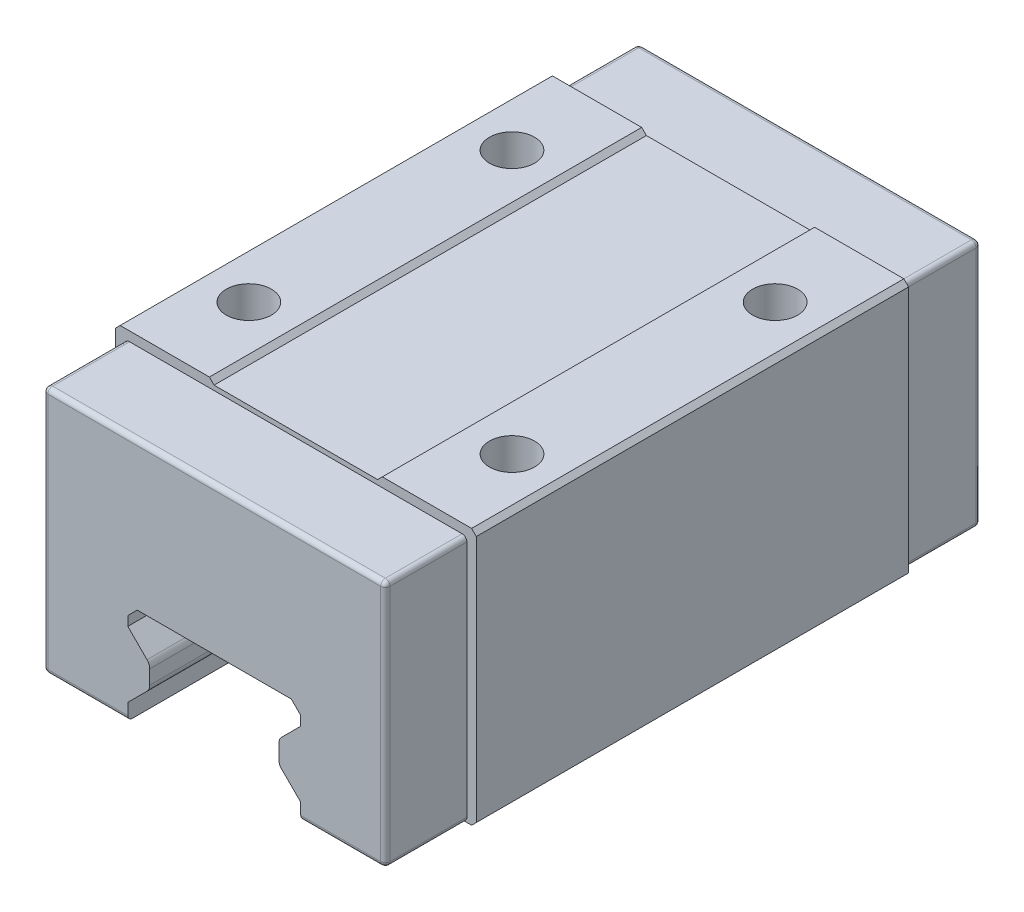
ISO-10303-21;
HEADER;
FILE_DESCRIPTION(('STEP AP214'),'2;1');
FILE_NAME('part.step','',(''),(''),'','','');
FILE_SCHEMA(('AUTOMOTIVE_DESIGN { 1 0 10303 214 1 1 1 1 }'));
ENDSEC;
DATA;
#1=APPLICATION_CONTEXT('core data for automotive mechanical design processes');
#2=APPLICATION_PROTOCOL_DEFINITION('international standard','automotive_design',2000,#1);
#3=PRODUCT_CONTEXT('',#1,'mechanical');
#4=PRODUCT('Part','Part','',(#3));
#5=PRODUCT_RELATED_PRODUCT_CATEGORY('part','',(#4));
#6=PRODUCT_DEFINITION_FORMATION('','',#4);
#7=PRODUCT_DEFINITION_CONTEXT('part definition',#1,'design');
#8=PRODUCT_DEFINITION('design','',#6,#7);
#9=PRODUCT_DEFINITION_SHAPE('','',#8);
#10=(LENGTH_UNIT() NAMED_UNIT(*) SI_UNIT(.MILLI.,.METRE.));
#11=(NAMED_UNIT(*) PLANE_ANGLE_UNIT() SI_UNIT($,.RADIAN.));
#12=(NAMED_UNIT(*) SI_UNIT($,.STERADIAN.) SOLID_ANGLE_UNIT());
#13=UNCERTAINTY_MEASURE_WITH_UNIT(LENGTH_MEASURE(1.E-05),#10,'distance_accuracy_value','');
#14=(GEOMETRIC_REPRESENTATION_CONTEXT(3) GLOBAL_UNCERTAINTY_ASSIGNED_CONTEXT((#13)) GLOBAL_UNIT_ASSIGNED_CONTEXT((#10,
#11,#12)) REPRESENTATION_CONTEXT('',''));
#15=CARTESIAN_POINT('',(0.,0.,0.));
#16=DIRECTION('',(0.,0.,1.));
#17=DIRECTION('',(1.,0.,0.));
#18=AXIS2_PLACEMENT_3D('',#15,#16,#17);
#19=CARTESIAN_POINT('',(-24.,40.,28.75));
#20=DIRECTION('',(0.,-1.,0.));
#21=DIRECTION('',(0.,0.,-1.));
#22=AXIS2_PLACEMENT_3D('',#19,#20,#21);
#23=PLANE('',#22);
#24=CARTESIAN_POINT('',(-17.5,40.,17.5));
#25=DIRECTION('',(0.,1.,0.));
#26=DIRECTION('',(-1.,0.,0.));
#27=AXIS2_PLACEMENT_3D('',#24,#25,#26);
#28=CIRCLE('',#27,3.);
#29=CARTESIAN_POINT('',(-20.5,40.,17.5));
#30=VERTEX_POINT('',#29);
#31=EDGE_CURVE('E1100',#30,#30,#28,.T.);
#32=ORIENTED_EDGE('',*,*,#31,.F.);
#33=EDGE_LOOP('',(#32));
#34=FACE_BOUND('',#33,.T.);
#35=CARTESIAN_POINT('',(-17.5,40.,-17.5));
#36=DIRECTION('',(0.,1.,0.));
#37=DIRECTION('',(-1.,0.,0.));
#38=AXIS2_PLACEMENT_3D('',#35,#36,#37);
#39=CIRCLE('',#38,3.);
#40=CARTESIAN_POINT('',(-20.5,40.,-17.5));
#41=VERTEX_POINT('',#40);
#42=EDGE_CURVE('E1078',#41,#41,#39,.T.);
#43=ORIENTED_EDGE('',*,*,#42,.F.);
#44=EDGE_LOOP('',(#43));
#45=FACE_BOUND('',#44,.T.);
#46=DIRECTION('',(-1.,0.,0.));
#47=VECTOR('',#46,1.);
#48=CARTESIAN_POINT('',(-24.,40.,-28.75));
#49=LINE('',#48,#47);
#50=CARTESIAN_POINT('',(-11.5,40.,-28.75));
#51=VERTEX_POINT('',#50);
#52=CARTESIAN_POINT('',(-23.375,40.,-28.75));
#53=VERTEX_POINT('',#52);
#54=EDGE_CURVE('E791',#51,#53,#49,.T.);
#55=ORIENTED_EDGE('',*,*,#54,.T.);
#56=DIRECTION('',(0.,0.,1.));
#57=VECTOR('',#56,1.);
#58=CARTESIAN_POINT('',(-23.375,40.,28.75));
#59=LINE('',#58,#57);
#60=CARTESIAN_POINT('',(-23.375,40.,28.75));
#61=VERTEX_POINT('',#60);
#62=EDGE_CURVE('E391',#53,#61,#59,.T.);
#63=ORIENTED_EDGE('',*,*,#62,.T.);
#64=DIRECTION('',(-1.,0.,0.));
#65=VECTOR('',#64,1.);
#66=CARTESIAN_POINT('',(-24.,40.,28.75));
#67=LINE('',#66,#65);
#68=CARTESIAN_POINT('',(-11.5,40.,28.75));
#69=VERTEX_POINT('',#68);
#70=EDGE_CURVE('E374',#69,#61,#67,.T.);
#71=ORIENTED_EDGE('',*,*,#70,.F.);
#72=DIRECTION('',(0.,0.,-1.));
#73=VECTOR('',#72,1.);
#74=CARTESIAN_POINT('',(-11.5,40.,28.75));
#75=LINE('',#74,#73);
#76=EDGE_CURVE('E388',#69,#51,#75,.T.);
#77=ORIENTED_EDGE('',*,*,#76,.T.);
#78=EDGE_LOOP('',(#55,#63,#71,#77));
#79=FACE_BOUND('',#78,.T.);
#80=ADVANCED_FACE('F39',(#34,#45,#79),#23,.F.);
#81=CARTESIAN_POINT('',(11.5,19.2,-39.6));
#82=DIRECTION('',(1.,0.,0.));
#83=DIRECTION('',(0.,1.,0.));
#84=AXIS2_PLACEMENT_3D('',#81,#82,#83);
#85=PLANE('',#84);
#86=DIRECTION('',(0.,-1.,0.));
#87=VECTOR('',#86,1.);
#88=CARTESIAN_POINT('',(11.5,0.,39.6));
#89=LINE('',#88,#87);
#90=CARTESIAN_POINT('',(11.5,17.95,39.6));
#91=VERTEX_POINT('',#90);
#92=CARTESIAN_POINT('',(11.5,16.7,39.6));
#93=VERTEX_POINT('',#92);
#94=EDGE_CURVE('E814',#91,#93,#89,.T.);
#95=ORIENTED_EDGE('',*,*,#94,.F.);
#96=DIRECTION('',(0.,0.,-1.));
#97=VECTOR('',#96,1.);
#98=CARTESIAN_POINT('',(11.5,17.95,-39.6));
#99=LINE('',#98,#97);
#100=CARTESIAN_POINT('',(11.5,17.95,-39.6));
#101=VERTEX_POINT('',#100);
#102=EDGE_CURVE('E823',#91,#101,#99,.T.);
#103=ORIENTED_EDGE('',*,*,#102,.T.);
#104=DIRECTION('',(0.,1.,0.));
#105=VECTOR('',#104,1.);
#106=CARTESIAN_POINT('',(11.5,19.2,-39.6));
#107=LINE('',#106,#105);
#108=CARTESIAN_POINT('',(11.5,16.7,-39.6));
#109=VERTEX_POINT('',#108);
#110=EDGE_CURVE('E948',#109,#101,#107,.T.);
#111=ORIENTED_EDGE('',*,*,#110,.F.);
#112=DIRECTION('',(0.,0.,1.));
#113=VECTOR('',#112,1.);
#114=CARTESIAN_POINT('',(11.5,16.7,-48.8233098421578));
#115=LINE('',#114,#113);
#116=EDGE_CURVE('E1060',#109,#93,#115,.T.);
#117=ORIENTED_EDGE('',*,*,#116,.T.);
#118=EDGE_LOOP('',(#95,#103,#111,#117));
#119=FACE_BOUND('',#118,.T.);
#120=ADVANCED_FACE('F1119',(#119),#85,.F.);
#121=CARTESIAN_POINT('',(-11.5,19.2,-39.6));
#122=DIRECTION('',(-1.,0.,0.));
#123=DIRECTION('',(0.,-1.,0.));
#124=AXIS2_PLACEMENT_3D('',#121,#122,#123);
#125=PLANE('',#124);
#126=DIRECTION('',(0.,-1.,0.));
#127=VECTOR('',#126,1.);
#128=CARTESIAN_POINT('',(-11.5,19.2,39.6));
#129=LINE('',#128,#127);
#130=CARTESIAN_POINT('',(-11.5,7.95,39.6));
#131=VERTEX_POINT('',#130);
#132=CARTESIAN_POINT('',(-11.5,6.425,39.6));
#133=VERTEX_POINT('',#132);
#134=EDGE_CURVE('E957',#131,#133,#129,.T.);
#135=ORIENTED_EDGE('',*,*,#134,.T.);
#136=CARTESIAN_POINT('',(-11.5,6.425,38.975));
#137=DIRECTION('',(-1.,0.,0.));
#138=DIRECTION('',(0.,-1.,0.));
#139=AXIS2_PLACEMENT_3D('',#136,#137,#138);
#140=CIRCLE('',#139,0.625);
#141=CARTESIAN_POINT('',(-11.5,5.8,38.975));
#142=VERTEX_POINT('',#141);
#143=EDGE_CURVE('E561',#133,#142,#140,.F.);
#144=ORIENTED_EDGE('',*,*,#143,.T.);
#145=DIRECTION('',(0.,0.,1.));
#146=VECTOR('',#145,1.);
#147=CARTESIAN_POINT('',(-11.5,5.8,28.75));
#148=LINE('',#147,#146);
#149=CARTESIAN_POINT('',(-11.5,5.8,-38.975));
#150=VERTEX_POINT('',#149);
#151=EDGE_CURVE('E753',#150,#142,#148,.T.);
#152=ORIENTED_EDGE('',*,*,#151,.F.);
#153=CARTESIAN_POINT('',(-11.5,6.425,-38.975));
#154=DIRECTION('',(-1.,0.,0.));
#155=DIRECTION('',(0.,-1.,0.));
#156=AXIS2_PLACEMENT_3D('',#153,#154,#155);
#157=CIRCLE('',#156,0.625);
#158=CARTESIAN_POINT('',(-11.5,6.425,-39.6));
#159=VERTEX_POINT('',#158);
#160=EDGE_CURVE('E558',#150,#159,#157,.F.);
#161=ORIENTED_EDGE('',*,*,#160,.T.);
#162=DIRECTION('',(0.,-1.,0.));
#163=VECTOR('',#162,1.);
#164=CARTESIAN_POINT('',(-11.5,19.2,-39.6));
#165=LINE('',#164,#163);
#166=CARTESIAN_POINT('',(-11.5,7.95,-39.6));
#167=VERTEX_POINT('',#166);
#168=EDGE_CURVE('E952',#167,#159,#165,.T.);
#169=ORIENTED_EDGE('',*,*,#168,.F.);
#170=DIRECTION('',(0.,0.,1.));
#171=VECTOR('',#170,1.);
#172=CARTESIAN_POINT('',(-11.5,7.95,-48.8233098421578));
#173=LINE('',#172,#171);
#174=EDGE_CURVE('E922',#167,#131,#173,.T.);
#175=ORIENTED_EDGE('',*,*,#174,.T.);
#176=EDGE_LOOP('',(#135,#144,#152,#161,#169,#175));
#177=FACE_BOUND('',#176,.T.);
#178=ADVANCED_FACE('F971',(#177),#125,.F.);
#179=CARTESIAN_POINT('',(-24.,5.8,28.75));
#180=DIRECTION('',(0.,1.,0.));
#181=DIRECTION('',(-1.,0.,0.));
#182=AXIS2_PLACEMENT_3D('',#179,#180,#181);
#183=PLANE('',#182);
#184=DIRECTION('',(0.,0.,-1.));
#185=VECTOR('',#184,1.);
#186=CARTESIAN_POINT('',(22.125,5.8,28.75));
#187=LINE('',#186,#185);
#188=CARTESIAN_POINT('',(22.125,5.8,28.75));
#189=VERTEX_POINT('',#188);
#190=CARTESIAN_POINT('',(22.125,5.8,38.975));
#191=VERTEX_POINT('',#190);
#192=EDGE_CURVE('E507',#189,#191,#187,.F.);
#193=ORIENTED_EDGE('',*,*,#192,.T.);
#194=DIRECTION('',(1.,0.,0.));
#195=VECTOR('',#194,1.);
#196=CARTESIAN_POINT('',(-24.,5.8,38.975));
#197=LINE('',#196,#195);
#198=CARTESIAN_POINT('',(11.5,5.8,38.975));
#199=VERTEX_POINT('',#198);
#200=EDGE_CURVE('E510',#191,#199,#197,.F.);
#201=ORIENTED_EDGE('',*,*,#200,.T.);
#202=DIRECTION('',(0.,0.,-1.));
#203=VECTOR('',#202,1.);
#204=CARTESIAN_POINT('',(11.5,5.8,28.75));
#205=LINE('',#204,#203);
#206=CARTESIAN_POINT('',(11.5,5.8,-38.975));
#207=VERTEX_POINT('',#206);
#208=EDGE_CURVE('E745',#199,#207,#205,.T.);
#209=ORIENTED_EDGE('',*,*,#208,.T.);
#210=DIRECTION('',(1.,0.,0.));
#211=VECTOR('',#210,1.);
#212=CARTESIAN_POINT('',(22.75,5.8,-38.975));
#213=LINE('',#212,#211);
#214=CARTESIAN_POINT('',(22.125,5.8,-38.975));
#215=VERTEX_POINT('',#214);
#216=EDGE_CURVE('E504',#207,#215,#213,.T.);
#217=ORIENTED_EDGE('',*,*,#216,.T.);
#218=DIRECTION('',(0.,0.,-1.));
#219=VECTOR('',#218,1.);
#220=CARTESIAN_POINT('',(22.125,5.8,28.75));
#221=LINE('',#220,#219);
#222=CARTESIAN_POINT('',(22.125,5.8,-28.75));
#223=VERTEX_POINT('',#222);
#224=EDGE_CURVE('E500',#215,#223,#221,.F.);
#225=ORIENTED_EDGE('',*,*,#224,.T.);
#226=DIRECTION('',(1.,0.,0.));
#227=VECTOR('',#226,1.);
#228=CARTESIAN_POINT('',(-24.,5.8,-28.75));
#229=LINE('',#228,#227);
#230=CARTESIAN_POINT('',(23.375,5.8,-28.75));
#231=VERTEX_POINT('',#230);
#232=EDGE_CURVE('E800',#223,#231,#229,.T.);
#233=ORIENTED_EDGE('',*,*,#232,.T.);
#234=DIRECTION('',(0.,0.,1.));
#235=VECTOR('',#234,1.);
#236=CARTESIAN_POINT('',(23.375,5.8,28.75));
#237=LINE('',#236,#235);
#238=CARTESIAN_POINT('',(23.375,5.8,28.75));
#239=VERTEX_POINT('',#238);
#240=EDGE_CURVE('E448',#231,#239,#237,.T.);
#241=ORIENTED_EDGE('',*,*,#240,.T.);
#242=DIRECTION('',(1.,0.,0.));
#243=VECTOR('',#242,1.);
#244=CARTESIAN_POINT('',(-24.,5.8,28.75));
#245=LINE('',#244,#243);
#246=EDGE_CURVE('E783',#189,#239,#245,.T.);
#247=ORIENTED_EDGE('',*,*,#246,.F.);
#248=EDGE_LOOP('',(#193,#201,#209,#217,#225,#233,#241,#247));
#249=FACE_BOUND('',#248,.T.);
#250=ADVANCED_FACE('F744',(#249),#183,.F.);
#251=CARTESIAN_POINT('',(0.,0.,28.75));
#252=DIRECTION('',(0.,0.,-1.));
#253=DIRECTION('',(-1.,0.,0.));
#254=AXIS2_PLACEMENT_3D('',#251,#252,#253);
#255=PLANE('',#254);
#256=DIRECTION('',(0.,1.,0.));
#257=VECTOR('',#256,1.);
#258=CARTESIAN_POINT('',(24.,5.8,28.75));
#259=LINE('',#258,#257);
#260=CARTESIAN_POINT('',(24.,6.425,28.75));
#261=VERTEX_POINT('',#260);
#262=CARTESIAN_POINT('',(24.,39.375,28.75));
#263=VERTEX_POINT('',#262);
#264=EDGE_CURVE('E394',#261,#263,#259,.T.);
#265=ORIENTED_EDGE('',*,*,#264,.T.);
#266=DIRECTION('',(0.707106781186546,-0.70710678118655,0.));
#267=VECTOR('',#266,1.);
#268=CARTESIAN_POINT('',(23.375,40.,28.75));
#269=LINE('',#268,#267);
#270=CARTESIAN_POINT('',(23.375,40.,28.75));
#271=VERTEX_POINT('',#270);
#272=EDGE_CURVE('E445',#263,#271,#269,.F.);
#273=ORIENTED_EDGE('',*,*,#272,.T.);
#274=CARTESIAN_POINT('',(11.5,40.,28.75));
#275=VERTEX_POINT('',#274);
#276=EDGE_CURVE('E393',#271,#275,#67,.T.);
#277=ORIENTED_EDGE('',*,*,#276,.T.);
#278=DIRECTION('',(0.707106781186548,0.707106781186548,0.));
#279=VECTOR('',#278,1.);
#280=CARTESIAN_POINT('',(-14.25,14.25,28.75));
#281=LINE('',#280,#279);
#282=CARTESIAN_POINT('',(10.875,39.375,28.75));
#283=VERTEX_POINT('',#282);
#284=EDGE_CURVE('E470',#275,#283,#281,.F.);
#285=ORIENTED_EDGE('',*,*,#284,.T.);
#286=DIRECTION('',(1.,0.,0.));
#287=VECTOR('',#286,1.);
#288=CARTESIAN_POINT('',(-11.5,39.375,28.75));
#289=LINE('',#288,#287);
#290=CARTESIAN_POINT('',(-10.875,39.375,28.75));
#291=VERTEX_POINT('',#290);
#292=EDGE_CURVE('E377',#291,#283,#289,.T.);
#293=ORIENTED_EDGE('',*,*,#292,.F.);
#294=DIRECTION('',(0.707106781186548,-0.707106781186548,0.));
#295=VECTOR('',#294,1.);
#296=CARTESIAN_POINT('',(14.25,14.25,28.75));
#297=LINE('',#296,#295);
#298=EDGE_CURVE('E370',#291,#69,#297,.F.);
#299=ORIENTED_EDGE('',*,*,#298,.T.);
#300=ORIENTED_EDGE('',*,*,#70,.T.);
#301=DIRECTION('',(0.707106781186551,0.707106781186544,0.));
#302=VECTOR('',#301,1.);
#303=CARTESIAN_POINT('',(-24.,39.375,28.75));
#304=LINE('',#303,#302);
#305=CARTESIAN_POINT('',(-24.,39.375,28.75));
#306=VERTEX_POINT('',#305);
#307=EDGE_CURVE('E436',#61,#306,#304,.F.);
#308=ORIENTED_EDGE('',*,*,#307,.T.);
#309=DIRECTION('',(0.,-1.,0.));
#310=VECTOR('',#309,1.);
#311=CARTESIAN_POINT('',(-24.,5.8,28.75));
#312=LINE('',#311,#310);
#313=CARTESIAN_POINT('',(-24.,6.425,28.75));
#314=VERTEX_POINT('',#313);
#315=EDGE_CURVE('E780',#306,#314,#312,.T.);
#316=ORIENTED_EDGE('',*,*,#315,.T.);
#317=DIRECTION('',(-0.707106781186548,0.707106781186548,0.));
#318=VECTOR('',#317,1.);
#319=CARTESIAN_POINT('',(-23.375,5.8,28.75));
#320=LINE('',#319,#318);
#321=CARTESIAN_POINT('',(-23.375,5.8,28.75));
#322=VERTEX_POINT('',#321);
#323=EDGE_CURVE('E439',#314,#322,#320,.F.);
#324=ORIENTED_EDGE('',*,*,#323,.T.);
#325=CARTESIAN_POINT('',(-22.125,5.8,28.75));
#326=VERTEX_POINT('',#325);
#327=EDGE_CURVE('E784',#322,#326,#245,.T.);
#328=ORIENTED_EDGE('',*,*,#327,.T.);
#329=CARTESIAN_POINT('',(-22.125,6.425,28.75));
#330=DIRECTION('',(0.,0.,-1.));
#331=DIRECTION('',(-1.,0.,0.));
#332=AXIS2_PLACEMENT_3D('',#329,#330,#331);
#333=CIRCLE('',#332,0.625);
#334=CARTESIAN_POINT('',(-22.75,6.425,28.75));
#335=VERTEX_POINT('',#334);
#336=EDGE_CURVE('E602',#326,#335,#333,.T.);
#337=ORIENTED_EDGE('',*,*,#336,.T.);
#338=DIRECTION('',(0.,-1.,0.));
#339=VECTOR('',#338,1.);
#340=CARTESIAN_POINT('',(-22.75,0.,28.75));
#341=LINE('',#340,#339);
#342=CARTESIAN_POINT('',(-22.75,38.125,28.75));
#343=VERTEX_POINT('',#342);
#344=EDGE_CURVE('E770',#343,#335,#341,.T.);
#345=ORIENTED_EDGE('',*,*,#344,.F.);
#346=CARTESIAN_POINT('',(-22.125,38.125,28.75));
#347=DIRECTION('',(0.,0.,-1.));
#348=DIRECTION('',(-1.,0.,0.));
#349=AXIS2_PLACEMENT_3D('',#346,#347,#348);
#350=CIRCLE('',#349,0.625);
#351=CARTESIAN_POINT('',(-22.125,38.75,28.75));
#352=VERTEX_POINT('',#351);
#353=EDGE_CURVE('E609',#343,#352,#350,.T.);
#354=ORIENTED_EDGE('',*,*,#353,.T.);
#355=DIRECTION('',(-1.,0.,0.));
#356=VECTOR('',#355,1.);
#357=CARTESIAN_POINT('',(0.,38.75,28.75));
#358=LINE('',#357,#356);
#359=CARTESIAN_POINT('',(22.125,38.75,28.75));
#360=VERTEX_POINT('',#359);
#361=EDGE_CURVE('E752',#360,#352,#358,.T.);
#362=ORIENTED_EDGE('',*,*,#361,.F.);
#363=CARTESIAN_POINT('',(22.125,38.125,28.75));
#364=DIRECTION('',(0.,0.,-1.));
#365=DIRECTION('',(-1.,0.,0.));
#366=AXIS2_PLACEMENT_3D('',#363,#364,#365);
#367=CIRCLE('',#366,0.625);
#368=CARTESIAN_POINT('',(22.75,38.125,28.75));
#369=VERTEX_POINT('',#368);
#370=EDGE_CURVE('E612',#360,#369,#367,.T.);
#371=ORIENTED_EDGE('',*,*,#370,.T.);
#372=DIRECTION('',(0.,1.,0.));
#373=VECTOR('',#372,1.);
#374=CARTESIAN_POINT('',(22.75,0.,28.75));
#375=LINE('',#374,#373);
#376=CARTESIAN_POINT('',(22.75,6.425,28.75));
#377=VERTEX_POINT('',#376);
#378=EDGE_CURVE('E759',#377,#369,#375,.T.);
#379=ORIENTED_EDGE('',*,*,#378,.F.);
#380=CARTESIAN_POINT('',(22.125,6.425,28.75));
#381=DIRECTION('',(0.,0.,-1.));
#382=DIRECTION('',(-1.,0.,0.));
#383=AXIS2_PLACEMENT_3D('',#380,#381,#382);
#384=CIRCLE('',#383,0.625);
#385=EDGE_CURVE('E605',#377,#189,#384,.T.);
#386=ORIENTED_EDGE('',*,*,#385,.T.);
#387=ORIENTED_EDGE('',*,*,#246,.T.);
#388=DIRECTION('',(-0.707106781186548,-0.707106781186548,0.));
#389=VECTOR('',#388,1.);
#390=CARTESIAN_POINT('',(24.,6.425,28.75));
#391=LINE('',#390,#389);
#392=EDGE_CURVE('E442',#239,#261,#391,.F.);
#393=ORIENTED_EDGE('',*,*,#392,.T.);
#394=EDGE_LOOP('',(#265,#273,#277,#285,#293,#299,#300,#308,#316,#324,#328,#337,#345,#354,#362,
#371,#379,#386,#387,#393));
#395=FACE_BOUND('',#394,.T.);
#396=ADVANCED_FACE('F373',(#395),#255,.F.);
#397=CARTESIAN_POINT('',(0.,0.,-28.75));
#398=DIRECTION('',(0.,0.,-1.));
#399=DIRECTION('',(-1.,0.,0.));
#400=AXIS2_PLACEMENT_3D('',#397,#398,#399);
#401=PLANE('',#400);
#402=CARTESIAN_POINT('',(23.375,40.,-28.75));
#403=VERTEX_POINT('',#402);
#404=CARTESIAN_POINT('',(11.5,40.,-28.75));
#405=VERTEX_POINT('',#404);
#406=EDGE_CURVE('E792',#403,#405,#49,.T.);
#407=ORIENTED_EDGE('',*,*,#406,.F.);
#408=DIRECTION('',(-0.707106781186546,0.70710678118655,0.));
#409=VECTOR('',#408,1.);
#410=CARTESIAN_POINT('',(31.6875000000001,31.6874999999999,-28.75));
#411=LINE('',#410,#409);
#412=CARTESIAN_POINT('',(24.,39.375,-28.75));
#413=VERTEX_POINT('',#412);
#414=EDGE_CURVE('E426',#403,#413,#411,.F.);
#415=ORIENTED_EDGE('',*,*,#414,.T.);
#416=DIRECTION('',(0.,1.,0.));
#417=VECTOR('',#416,1.);
#418=CARTESIAN_POINT('',(24.,5.8,-28.75));
#419=LINE('',#418,#417);
#420=CARTESIAN_POINT('',(24.,6.425,-28.75));
#421=VERTEX_POINT('',#420);
#422=EDGE_CURVE('E774',#421,#413,#419,.T.);
#423=ORIENTED_EDGE('',*,*,#422,.F.);
#424=DIRECTION('',(0.707106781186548,0.707106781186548,0.));
#425=VECTOR('',#424,1.);
#426=CARTESIAN_POINT('',(8.7875,-8.7875,-28.75));
#427=LINE('',#426,#425);
#428=EDGE_CURVE('E423',#421,#231,#427,.F.);
#429=ORIENTED_EDGE('',*,*,#428,.T.);
#430=ORIENTED_EDGE('',*,*,#232,.F.);
#431=CARTESIAN_POINT('',(22.125,6.425,-28.75));
#432=DIRECTION('',(0.,0.,-1.));
#433=DIRECTION('',(-1.,0.,0.));
#434=AXIS2_PLACEMENT_3D('',#431,#432,#433);
#435=CIRCLE('',#434,0.625);
#436=CARTESIAN_POINT('',(22.75,6.425,-28.75));
#437=VERTEX_POINT('',#436);
#438=EDGE_CURVE('E615',#223,#437,#435,.F.);
#439=ORIENTED_EDGE('',*,*,#438,.T.);
#440=DIRECTION('',(0.,1.,0.));
#441=VECTOR('',#440,1.);
#442=CARTESIAN_POINT('',(22.75,0.,-28.75));
#443=LINE('',#442,#441);
#444=CARTESIAN_POINT('',(22.75,38.125,-28.75));
#445=VERTEX_POINT('',#444);
#446=EDGE_CURVE('E806',#437,#445,#443,.T.);
#447=ORIENTED_EDGE('',*,*,#446,.T.);
#448=CARTESIAN_POINT('',(22.125,38.125,-28.75));
#449=DIRECTION('',(0.,0.,-1.));
#450=DIRECTION('',(-1.,0.,0.));
#451=AXIS2_PLACEMENT_3D('',#448,#449,#450);
#452=CIRCLE('',#451,0.625);
#453=CARTESIAN_POINT('',(22.125,38.75,-28.75));
#454=VERTEX_POINT('',#453);
#455=EDGE_CURVE('E49',#445,#454,#452,.F.);
#456=ORIENTED_EDGE('',*,*,#455,.T.);
#457=DIRECTION('',(-1.,0.,0.));
#458=VECTOR('',#457,1.);
#459=CARTESIAN_POINT('',(0.,38.75,-28.75));
#460=LINE('',#459,#458);
#461=CARTESIAN_POINT('',(-22.125,38.75,-28.75));
#462=VERTEX_POINT('',#461);
#463=EDGE_CURVE('E787',#454,#462,#460,.T.);
#464=ORIENTED_EDGE('',*,*,#463,.T.);
#465=CARTESIAN_POINT('',(-22.125,38.125,-28.75));
#466=DIRECTION('',(0.,0.,-1.));
#467=DIRECTION('',(-1.,0.,0.));
#468=AXIS2_PLACEMENT_3D('',#465,#466,#467);
#469=CIRCLE('',#468,0.625);
#470=CARTESIAN_POINT('',(-22.75,38.125,-28.75));
#471=VERTEX_POINT('',#470);
#472=EDGE_CURVE('E11',#462,#471,#469,.F.);
#473=ORIENTED_EDGE('',*,*,#472,.T.);
#474=DIRECTION('',(0.,-1.,0.));
#475=VECTOR('',#474,1.);
#476=CARTESIAN_POINT('',(-22.75,0.,-28.75));
#477=LINE('',#476,#475);
#478=CARTESIAN_POINT('',(-22.75,6.425,-28.75));
#479=VERTEX_POINT('',#478);
#480=EDGE_CURVE('E810',#471,#479,#477,.T.);
#481=ORIENTED_EDGE('',*,*,#480,.T.);
#482=CARTESIAN_POINT('',(-22.125,6.425,-28.75));
#483=DIRECTION('',(0.,0.,-1.));
#484=DIRECTION('',(-1.,0.,0.));
#485=AXIS2_PLACEMENT_3D('',#482,#483,#484);
#486=CIRCLE('',#485,0.625);
#487=CARTESIAN_POINT('',(-22.125,5.8,-28.75));
#488=VERTEX_POINT('',#487);
#489=EDGE_CURVE('E598',#479,#488,#486,.F.);
#490=ORIENTED_EDGE('',*,*,#489,.T.);
#491=CARTESIAN_POINT('',(-23.375,5.8,-28.75));
#492=VERTEX_POINT('',#491);
#493=EDGE_CURVE('E776',#492,#488,#229,.T.);
#494=ORIENTED_EDGE('',*,*,#493,.F.);
#495=DIRECTION('',(0.707106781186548,-0.707106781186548,0.));
#496=VECTOR('',#495,1.);
#497=CARTESIAN_POINT('',(-8.7875,-8.7875,-28.75));
#498=LINE('',#497,#496);
#499=CARTESIAN_POINT('',(-24.,6.425,-28.75));
#500=VERTEX_POINT('',#499);
#501=EDGE_CURVE('E420',#492,#500,#498,.F.);
#502=ORIENTED_EDGE('',*,*,#501,.T.);
#503=DIRECTION('',(0.,-1.,0.));
#504=VECTOR('',#503,1.);
#505=CARTESIAN_POINT('',(-24.,5.8,-28.75));
#506=LINE('',#505,#504);
#507=CARTESIAN_POINT('',(-24.,39.375,-28.75));
#508=VERTEX_POINT('',#507);
#509=EDGE_CURVE('E796',#508,#500,#506,.T.);
#510=ORIENTED_EDGE('',*,*,#509,.F.);
#511=DIRECTION('',(-0.707106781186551,-0.707106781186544,0.));
#512=VECTOR('',#511,1.);
#513=CARTESIAN_POINT('',(-31.6874999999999,31.6875000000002,-28.75));
#514=LINE('',#513,#512);
#515=EDGE_CURVE('E417',#508,#53,#514,.F.);
#516=ORIENTED_EDGE('',*,*,#515,.T.);
#517=ORIENTED_EDGE('',*,*,#54,.F.);
#518=DIRECTION('',(-0.707106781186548,0.707106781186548,0.));
#519=VECTOR('',#518,1.);
#520=CARTESIAN_POINT('',(-10.875,39.375,-28.75));
#521=LINE('',#520,#519);
#522=CARTESIAN_POINT('',(-10.875,39.375,-28.75));
#523=VERTEX_POINT('',#522);
#524=EDGE_CURVE('E383',#51,#523,#521,.F.);
#525=ORIENTED_EDGE('',*,*,#524,.T.);
#526=DIRECTION('',(-1.,0.,0.));
#527=VECTOR('',#526,1.);
#528=CARTESIAN_POINT('',(0.,39.375,-28.75));
#529=LINE('',#528,#527);
#530=CARTESIAN_POINT('',(10.875,39.375,-28.75));
#531=VERTEX_POINT('',#530);
#532=EDGE_CURVE('E399',#531,#523,#529,.T.);
#533=ORIENTED_EDGE('',*,*,#532,.F.);
#534=DIRECTION('',(-0.707106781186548,-0.707106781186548,0.));
#535=VECTOR('',#534,1.);
#536=CARTESIAN_POINT('',(11.5,40.,-28.75));
#537=LINE('',#536,#535);
#538=EDGE_CURVE('E384',#531,#405,#537,.F.);
#539=ORIENTED_EDGE('',*,*,#538,.T.);
#540=EDGE_LOOP('',(#407,#415,#423,#429,#430,#439,#447,#456,#464,#473,#481,#490,#494,#502,#510,
#516,#517,#525,#533,#539));
#541=FACE_BOUND('',#540,.T.);
#542=ADVANCED_FACE('F1027',(#541),#401,.T.);
#543=CARTESIAN_POINT('',(24.,5.8,28.75));
#544=DIRECTION('',(-1.,0.,0.));
#545=DIRECTION('',(0.,-1.,0.));
#546=AXIS2_PLACEMENT_3D('',#543,#544,#545);
#547=PLANE('',#546);
#548=ORIENTED_EDGE('',*,*,#422,.T.);
#549=DIRECTION('',(0.,0.,1.));
#550=VECTOR('',#549,1.);
#551=CARTESIAN_POINT('',(24.,39.375,28.75));
#552=LINE('',#551,#550);
#553=EDGE_CURVE('E433',#413,#263,#552,.T.);
#554=ORIENTED_EDGE('',*,*,#553,.T.);
#555=ORIENTED_EDGE('',*,*,#264,.F.);
#556=DIRECTION('',(0.,0.,-1.));
#557=VECTOR('',#556,1.);
#558=CARTESIAN_POINT('',(24.,6.425,28.75));
#559=LINE('',#558,#557);
#560=EDGE_CURVE('E429',#261,#421,#559,.T.);
#561=ORIENTED_EDGE('',*,*,#560,.T.);
#562=EDGE_LOOP('',(#548,#554,#555,#561));
#563=FACE_BOUND('',#562,.T.);
#564=ADVANCED_FACE('F1195',(#563),#547,.F.);
#565=CARTESIAN_POINT('',(17.5,40.,-17.5));
#566=DIRECTION('',(0.,1.,0.));
#567=DIRECTION('',(-1.,0.,0.));
#568=AXIS2_PLACEMENT_3D('',#565,#566,#567);
#569=CIRCLE('',#568,3.);
#570=CARTESIAN_POINT('',(14.5,40.,-17.5));
#571=VERTEX_POINT('',#570);
#572=EDGE_CURVE('E1085',#571,#571,#569,.T.);
#573=ORIENTED_EDGE('',*,*,#572,.F.);
#574=EDGE_LOOP('',(#573));
#575=FACE_BOUND('',#574,.T.);
#576=CARTESIAN_POINT('',(17.5,40.,17.5));
#577=DIRECTION('',(0.,1.,0.));
#578=DIRECTION('',(-1.,0.,0.));
#579=AXIS2_PLACEMENT_3D('',#576,#577,#578);
#580=CIRCLE('',#579,3.);
#581=CARTESIAN_POINT('',(14.5,40.,17.5));
#582=VERTEX_POINT('',#581);
#583=EDGE_CURVE('E1092',#582,#582,#580,.T.);
#584=ORIENTED_EDGE('',*,*,#583,.F.);
#585=EDGE_LOOP('',(#584));
#586=FACE_BOUND('',#585,.T.);
#587=ORIENTED_EDGE('',*,*,#276,.F.);
#588=DIRECTION('',(0.,0.,-1.));
#589=VECTOR('',#588,1.);
#590=CARTESIAN_POINT('',(23.375,40.,28.75));
#591=LINE('',#590,#589);
#592=EDGE_CURVE('E406',#271,#403,#591,.T.);
#593=ORIENTED_EDGE('',*,*,#592,.T.);
#594=ORIENTED_EDGE('',*,*,#406,.T.);
#595=DIRECTION('',(0.,0.,1.));
#596=VECTOR('',#595,1.);
#597=CARTESIAN_POINT('',(11.5,40.,28.75));
#598=LINE('',#597,#596);
#599=EDGE_CURVE('E400',#405,#275,#598,.T.);
#600=ORIENTED_EDGE('',*,*,#599,.T.);
#601=EDGE_LOOP('',(#587,#593,#594,#600));
#602=FACE_BOUND('',#601,.T.);
#603=ADVANCED_FACE('F1121',(#575,#586,#602),#23,.F.);
#604=CARTESIAN_POINT('',(-24.,5.8,28.75));
#605=DIRECTION('',(1.,0.,0.));
#606=DIRECTION('',(0.,0.,-1.));
#607=AXIS2_PLACEMENT_3D('',#604,#605,#606);
#608=PLANE('',#607);
#609=ORIENTED_EDGE('',*,*,#509,.T.);
#610=DIRECTION('',(0.,0.,1.));
#611=VECTOR('',#610,1.);
#612=CARTESIAN_POINT('',(-24.,6.425,28.75));
#613=LINE('',#612,#611);
#614=EDGE_CURVE('E459',#500,#314,#613,.T.);
#615=ORIENTED_EDGE('',*,*,#614,.T.);
#616=ORIENTED_EDGE('',*,*,#315,.F.);
#617=DIRECTION('',(0.,0.,-1.));
#618=VECTOR('',#617,1.);
#619=CARTESIAN_POINT('',(-24.,39.375,28.75));
#620=LINE('',#619,#618);
#621=EDGE_CURVE('E455',#306,#508,#620,.T.);
#622=ORIENTED_EDGE('',*,*,#621,.T.);
#623=EDGE_LOOP('',(#609,#615,#616,#622));
#624=FACE_BOUND('',#623,.T.);
#625=ADVANCED_FACE('F1198',(#624),#608,.F.);
#626=DIRECTION('',(0.,0.,-1.));
#627=VECTOR('',#626,1.);
#628=CARTESIAN_POINT('',(-22.125,5.8,28.75));
#629=LINE('',#628,#627);
#630=CARTESIAN_POINT('',(-22.125,5.8,38.975));
#631=VERTEX_POINT('',#630);
#632=EDGE_CURVE('E487',#631,#326,#629,.T.);
#633=ORIENTED_EDGE('',*,*,#632,.T.);
#634=ORIENTED_EDGE('',*,*,#327,.F.);
#635=DIRECTION('',(0.,0.,-1.));
#636=VECTOR('',#635,1.);
#637=CARTESIAN_POINT('',(-23.375,5.8,28.75));
#638=LINE('',#637,#636);
#639=EDGE_CURVE('E451',#322,#492,#638,.T.);
#640=ORIENTED_EDGE('',*,*,#639,.T.);
#641=ORIENTED_EDGE('',*,*,#493,.T.);
#642=DIRECTION('',(0.,0.,-1.));
#643=VECTOR('',#642,1.);
#644=CARTESIAN_POINT('',(-22.125,5.8,28.75));
#645=LINE('',#644,#643);
#646=CARTESIAN_POINT('',(-22.125,5.8,-38.975));
#647=VERTEX_POINT('',#646);
#648=EDGE_CURVE('E480',#488,#647,#645,.T.);
#649=ORIENTED_EDGE('',*,*,#648,.T.);
#650=DIRECTION('',(1.,0.,0.));
#651=VECTOR('',#650,1.);
#652=CARTESIAN_POINT('',(-11.5,5.8,-38.975));
#653=LINE('',#652,#651);
#654=EDGE_CURVE('E477',#647,#150,#653,.T.);
#655=ORIENTED_EDGE('',*,*,#654,.T.);
#656=ORIENTED_EDGE('',*,*,#151,.T.);
#657=DIRECTION('',(1.,0.,0.));
#658=VECTOR('',#657,1.);
#659=CARTESIAN_POINT('',(-24.,5.8,38.975));
#660=LINE('',#659,#658);
#661=EDGE_CURVE('E484',#142,#631,#660,.F.);
#662=ORIENTED_EDGE('',*,*,#661,.T.);
#663=EDGE_LOOP('',(#633,#634,#640,#641,#649,#655,#656,#662));
#664=FACE_BOUND('',#663,.T.);
#665=ADVANCED_FACE('F983',(#664),#183,.F.);
#666=CARTESIAN_POINT('',(0.,0.,-39.6));
#667=DIRECTION('',(0.,0.,-1.));
#668=DIRECTION('',(-1.,0.,0.));
#669=AXIS2_PLACEMENT_3D('',#666,#667,#668);
#670=PLANE('',#669);
#671=DIRECTION('',(0.,1.,0.));
#672=VECTOR('',#671,1.);
#673=CARTESIAN_POINT('',(22.125,5.8,-39.6));
#674=LINE('',#673,#672);
#675=CARTESIAN_POINT('',(22.125,38.125,-39.6));
#676=VERTEX_POINT('',#675);
#677=CARTESIAN_POINT('',(22.125,6.425,-39.6));
#678=VERTEX_POINT('',#677);
#679=EDGE_CURVE('E522',#676,#678,#674,.F.);
#680=ORIENTED_EDGE('',*,*,#679,.T.);
#681=DIRECTION('',(1.,0.,0.));
#682=VECTOR('',#681,1.);
#683=CARTESIAN_POINT('',(11.5,6.425,-39.6));
#684=LINE('',#683,#682);
#685=CARTESIAN_POINT('',(11.5,6.425,-39.6));
#686=VERTEX_POINT('',#685);
#687=EDGE_CURVE('E525',#678,#686,#684,.F.);
#688=ORIENTED_EDGE('',*,*,#687,.T.);
#689=CARTESIAN_POINT('',(11.5,7.95,-39.6));
#690=VERTEX_POINT('',#689);
#691=EDGE_CURVE('E944',#686,#690,#107,.T.);
#692=ORIENTED_EDGE('',*,*,#691,.T.);
#693=DIRECTION('',(0.707106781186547,-0.707106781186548,0.));
#694=VECTOR('',#693,1.);
#695=CARTESIAN_POINT('',(11.5,7.95,-39.6));
#696=LINE('',#695,#694);
#697=CARTESIAN_POINT('',(8.94944985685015,10.5005501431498,-39.6));
#698=VERTEX_POINT('',#697);
#699=EDGE_CURVE('E1046',#698,#690,#696,.T.);
#700=ORIENTED_EDGE('',*,*,#699,.F.);
#701=CARTESIAN_POINT('',(9.83333333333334,11.384433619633,-39.6));
#702=DIRECTION('',(0.,0.,-1.));
#703=DIRECTION('',(-1.,0.,0.));
#704=AXIS2_PLACEMENT_3D('',#701,#702,#703);
#705=CIRCLE('',#704,1.25);
#706=CARTESIAN_POINT('',(8.58333333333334,11.384433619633,-39.6));
#707=VERTEX_POINT('',#706);
#708=EDGE_CURVE('E872',#698,#707,#705,.T.);
#709=ORIENTED_EDGE('',*,*,#708,.T.);
#710=DIRECTION('',(0.,-1.,0.));
#711=VECTOR('',#710,1.);
#712=CARTESIAN_POINT('',(8.58333333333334,10.8666666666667,-39.6));
#713=LINE('',#712,#711);
#714=CARTESIAN_POINT('',(8.58333333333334,13.265566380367,-39.6));
#715=VERTEX_POINT('',#714);
#716=EDGE_CURVE('E1048',#715,#707,#713,.T.);
#717=ORIENTED_EDGE('',*,*,#716,.F.);
#718=CARTESIAN_POINT('',(9.83333333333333,13.265566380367,-39.6));
#719=DIRECTION('',(0.,0.,-1.));
#720=DIRECTION('',(-1.,0.,0.));
#721=AXIS2_PLACEMENT_3D('',#718,#719,#720);
#722=CIRCLE('',#721,1.25);
#723=CARTESIAN_POINT('',(8.94944985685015,14.1494498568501,-39.6));
#724=VERTEX_POINT('',#723);
#725=EDGE_CURVE('E869',#715,#724,#722,.T.);
#726=ORIENTED_EDGE('',*,*,#725,.T.);
#727=DIRECTION('',(-0.707106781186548,-0.707106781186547,0.));
#728=VECTOR('',#727,1.);
#729=CARTESIAN_POINT('',(8.58333333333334,13.7833333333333,-39.6));
#730=LINE('',#729,#728);
#731=EDGE_CURVE('E1052',#109,#724,#730,.T.);
#732=ORIENTED_EDGE('',*,*,#731,.F.);
#733=ORIENTED_EDGE('',*,*,#110,.T.);
#734=DIRECTION('',(0.707106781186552,-0.707106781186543,0.));
#735=VECTOR('',#734,1.);
#736=CARTESIAN_POINT('',(10.25,19.2,-39.6));
#737=LINE('',#736,#735);
#738=CARTESIAN_POINT('',(10.25,19.2,-39.6));
#739=VERTEX_POINT('',#738);
#740=EDGE_CURVE('E833',#101,#739,#737,.F.);
#741=ORIENTED_EDGE('',*,*,#740,.T.);
#742=DIRECTION('',(-1.,0.,0.));
#743=VECTOR('',#742,1.);
#744=CARTESIAN_POINT('',(-11.5,19.2,-39.6));
#745=LINE('',#744,#743);
#746=CARTESIAN_POINT('',(-10.25,19.2,-39.6));
#747=VERTEX_POINT('',#746);
#748=EDGE_CURVE('E947',#739,#747,#745,.T.);
#749=ORIENTED_EDGE('',*,*,#748,.T.);
#750=DIRECTION('',(0.707106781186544,0.707106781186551,0.));
#751=VECTOR('',#750,1.);
#752=CARTESIAN_POINT('',(-11.5,17.95,-39.6));
#753=LINE('',#752,#751);
#754=CARTESIAN_POINT('',(-11.5,17.95,-39.6));
#755=VERTEX_POINT('',#754);
#756=EDGE_CURVE('E839',#747,#755,#753,.F.);
#757=ORIENTED_EDGE('',*,*,#756,.T.);
#758=CARTESIAN_POINT('',(-11.5,16.7,-39.6));
#759=VERTEX_POINT('',#758);
#760=EDGE_CURVE('E763',#755,#759,#165,.T.);
#761=ORIENTED_EDGE('',*,*,#760,.T.);
#762=DIRECTION('',(-0.707106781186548,0.707106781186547,0.));
#763=VECTOR('',#762,1.);
#764=CARTESIAN_POINT('',(-8.58333333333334,13.7833333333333,-39.6));
#765=LINE('',#764,#763);
#766=CARTESIAN_POINT('',(-8.94944985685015,14.1494498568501,-39.6));
#767=VERTEX_POINT('',#766);
#768=EDGE_CURVE('E897',#767,#759,#765,.T.);
#769=ORIENTED_EDGE('',*,*,#768,.F.);
#770=CARTESIAN_POINT('',(-9.83333333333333,13.265566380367,-39.6));
#771=DIRECTION('',(0.,0.,-1.));
#772=DIRECTION('',(-1.,0.,0.));
#773=AXIS2_PLACEMENT_3D('',#770,#771,#772);
#774=CIRCLE('',#773,1.25);
#775=CARTESIAN_POINT('',(-8.58333333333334,13.265566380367,-39.6));
#776=VERTEX_POINT('',#775);
#777=EDGE_CURVE('E863',#767,#776,#774,.T.);
#778=ORIENTED_EDGE('',*,*,#777,.T.);
#779=DIRECTION('',(0.,1.,0.));
#780=VECTOR('',#779,1.);
#781=CARTESIAN_POINT('',(-8.58333333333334,10.8666666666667,-39.6));
#782=LINE('',#781,#780);
#783=CARTESIAN_POINT('',(-8.58333333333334,11.384433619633,-39.6));
#784=VERTEX_POINT('',#783);
#785=EDGE_CURVE('E910',#784,#776,#782,.T.);
#786=ORIENTED_EDGE('',*,*,#785,.F.);
#787=CARTESIAN_POINT('',(-9.83333333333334,11.384433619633,-39.6));
#788=DIRECTION('',(0.,0.,-1.));
#789=DIRECTION('',(-1.,0.,0.));
#790=AXIS2_PLACEMENT_3D('',#787,#788,#789);
#791=CIRCLE('',#790,1.25);
#792=CARTESIAN_POINT('',(-8.94944985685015,10.5005501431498,-39.6));
#793=VERTEX_POINT('',#792);
#794=EDGE_CURVE('E866',#784,#793,#791,.T.);
#795=ORIENTED_EDGE('',*,*,#794,.T.);
#796=DIRECTION('',(0.707106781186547,0.707106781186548,0.));
#797=VECTOR('',#796,1.);
#798=CARTESIAN_POINT('',(-11.5,7.95,-39.6));
#799=LINE('',#798,#797);
#800=EDGE_CURVE('E926',#167,#793,#799,.T.);
#801=ORIENTED_EDGE('',*,*,#800,.F.);
#802=ORIENTED_EDGE('',*,*,#168,.T.);
#803=DIRECTION('',(1.,0.,0.));
#804=VECTOR('',#803,1.);
#805=CARTESIAN_POINT('',(-22.75,6.425,-39.6));
#806=LINE('',#805,#804);
#807=CARTESIAN_POINT('',(-22.125,6.425,-39.6));
#808=VERTEX_POINT('',#807);
#809=EDGE_CURVE('E519',#159,#808,#806,.F.);
#810=ORIENTED_EDGE('',*,*,#809,.T.);
#811=DIRECTION('',(0.,-1.,0.));
#812=VECTOR('',#811,1.);
#813=CARTESIAN_POINT('',(-22.125,38.75,-39.6));
#814=LINE('',#813,#812);
#815=CARTESIAN_POINT('',(-22.125,38.125,-39.6));
#816=VERTEX_POINT('',#815);
#817=EDGE_CURVE('E516',#808,#816,#814,.F.);
#818=ORIENTED_EDGE('',*,*,#817,.T.);
#819=DIRECTION('',(-1.,0.,0.));
#820=VECTOR('',#819,1.);
#821=CARTESIAN_POINT('',(22.75,38.125,-39.6));
#822=LINE('',#821,#820);
#823=EDGE_CURVE('E513',#816,#676,#822,.F.);
#824=ORIENTED_EDGE('',*,*,#823,.T.);
#825=EDGE_LOOP('',(#680,#688,#692,#700,#709,#717,#726,#732,#733,#741,#749,#757,#761,#769,#778,
#786,#795,#801,#802,#810,#818,#824));
#826=FACE_BOUND('',#825,.T.);
#827=ADVANCED_FACE('F903',(#826),#670,.T.);
#828=CARTESIAN_POINT('',(-22.75,38.75,39.6));
#829=DIRECTION('',(0.,-1.,0.));
#830=DIRECTION('',(0.,0.,-1.));
#831=AXIS2_PLACEMENT_3D('',#828,#829,#830);
#832=PLANE('',#831);
#833=ORIENTED_EDGE('',*,*,#463,.F.);
#834=DIRECTION('',(0.,0.,-1.));
#835=VECTOR('',#834,1.);
#836=CARTESIAN_POINT('',(22.125,38.75,39.6));
#837=LINE('',#836,#835);
#838=CARTESIAN_POINT('',(22.125,38.75,-38.975));
#839=VERTEX_POINT('',#838);
#840=EDGE_CURVE('E62',#454,#839,#837,.T.);
#841=ORIENTED_EDGE('',*,*,#840,.T.);
#842=DIRECTION('',(-1.,0.,0.));
#843=VECTOR('',#842,1.);
#844=CARTESIAN_POINT('',(-22.75,38.75,-38.975));
#845=LINE('',#844,#843);
#846=CARTESIAN_POINT('',(-22.125,38.75,-38.975));
#847=VERTEX_POINT('',#846);
#848=EDGE_CURVE('E57',#839,#847,#845,.T.);
#849=ORIENTED_EDGE('',*,*,#848,.T.);
#850=DIRECTION('',(0.,0.,-1.));
#851=VECTOR('',#850,1.);
#852=CARTESIAN_POINT('',(-22.125,38.75,39.6));
#853=LINE('',#852,#851);
#854=EDGE_CURVE('E593',#847,#462,#853,.F.);
#855=ORIENTED_EDGE('',*,*,#854,.T.);
#856=EDGE_LOOP('',(#833,#841,#849,#855));
#857=FACE_BOUND('',#856,.T.);
#858=ADVANCED_FACE('F1180',(#857),#832,.F.);
#859=CARTESIAN_POINT('',(22.75,5.8,39.6));
#860=DIRECTION('',(-1.,0.,0.));
#861=DIRECTION('',(0.,0.,1.));
#862=AXIS2_PLACEMENT_3D('',#859,#860,#861);
#863=PLANE('',#862);
#864=ORIENTED_EDGE('',*,*,#446,.F.);
#865=DIRECTION('',(0.,0.,-1.));
#866=VECTOR('',#865,1.);
#867=CARTESIAN_POINT('',(22.75,6.425,39.6));
#868=LINE('',#867,#866);
#869=CARTESIAN_POINT('',(22.75,6.425,-38.975));
#870=VERTEX_POINT('',#869);
#871=EDGE_CURVE('E588',#437,#870,#868,.T.);
#872=ORIENTED_EDGE('',*,*,#871,.T.);
#873=DIRECTION('',(0.,1.,0.));
#874=VECTOR('',#873,1.);
#875=CARTESIAN_POINT('',(22.75,38.75,-38.975));
#876=LINE('',#875,#874);
#877=CARTESIAN_POINT('',(22.75,38.125,-38.975));
#878=VERTEX_POINT('',#877);
#879=EDGE_CURVE('E585',#870,#878,#876,.T.);
#880=ORIENTED_EDGE('',*,*,#879,.T.);
#881=DIRECTION('',(0.,0.,-1.));
#882=VECTOR('',#881,1.);
#883=CARTESIAN_POINT('',(22.75,38.125,39.6));
#884=LINE('',#883,#882);
#885=EDGE_CURVE('E582',#878,#445,#884,.F.);
#886=ORIENTED_EDGE('',*,*,#885,.T.);
#887=EDGE_LOOP('',(#864,#872,#880,#886));
#888=FACE_BOUND('',#887,.T.);
#889=ADVANCED_FACE('F1023',(#888),#863,.F.);
#890=CARTESIAN_POINT('',(-22.75,5.8,39.6));
#891=DIRECTION('',(1.,0.,0.));
#892=DIRECTION('',(0.,0.,-1.));
#893=AXIS2_PLACEMENT_3D('',#890,#891,#892);
#894=PLANE('',#893);
#895=DIRECTION('',(0.,-1.,0.));
#896=VECTOR('',#895,1.);
#897=CARTESIAN_POINT('',(-22.75,5.8,-38.975));
#898=LINE('',#897,#896);
#899=CARTESIAN_POINT('',(-22.75,38.125,-38.975));
#900=VERTEX_POINT('',#899);
#901=CARTESIAN_POINT('',(-22.75,6.425,-38.975));
#902=VERTEX_POINT('',#901);
#903=EDGE_CURVE('E491',#900,#902,#898,.T.);
#904=ORIENTED_EDGE('',*,*,#903,.T.);
#905=DIRECTION('',(0.,0.,-1.));
#906=VECTOR('',#905,1.);
#907=CARTESIAN_POINT('',(-22.75,6.425,39.6));
#908=LINE('',#907,#906);
#909=EDGE_CURVE('E497',#902,#479,#908,.F.);
#910=ORIENTED_EDGE('',*,*,#909,.T.);
#911=ORIENTED_EDGE('',*,*,#480,.F.);
#912=DIRECTION('',(0.,0.,-1.));
#913=VECTOR('',#912,1.);
#914=CARTESIAN_POINT('',(-22.75,38.125,39.6));
#915=LINE('',#914,#913);
#916=EDGE_CURVE('E494',#471,#900,#915,.T.);
#917=ORIENTED_EDGE('',*,*,#916,.T.);
#918=EDGE_LOOP('',(#904,#910,#911,#917));
#919=FACE_BOUND('',#918,.T.);
#920=ADVANCED_FACE('F1185',(#919),#894,.F.);
#921=ORIENTED_EDGE('',*,*,#344,.T.);
#922=DIRECTION('',(0.,0.,-1.));
#923=VECTOR('',#922,1.);
#924=CARTESIAN_POINT('',(-22.75,6.425,39.6));
#925=LINE('',#924,#923);
#926=CARTESIAN_POINT('',(-22.75,6.425,38.975));
#927=VERTEX_POINT('',#926);
#928=EDGE_CURVE('E540',#335,#927,#925,.F.);
#929=ORIENTED_EDGE('',*,*,#928,.T.);
#930=DIRECTION('',(0.,-1.,0.));
#931=VECTOR('',#930,1.);
#932=CARTESIAN_POINT('',(-22.75,5.8,38.975));
#933=LINE('',#932,#931);
#934=CARTESIAN_POINT('',(-22.75,38.125,38.975));
#935=VERTEX_POINT('',#934);
#936=EDGE_CURVE('E537',#927,#935,#933,.F.);
#937=ORIENTED_EDGE('',*,*,#936,.T.);
#938=DIRECTION('',(0.,0.,-1.));
#939=VECTOR('',#938,1.);
#940=CARTESIAN_POINT('',(-22.75,38.125,39.6));
#941=LINE('',#940,#939);
#942=EDGE_CURVE('E534',#935,#343,#941,.T.);
#943=ORIENTED_EDGE('',*,*,#942,.T.);
#944=EDGE_LOOP('',(#921,#929,#937,#943));
#945=FACE_BOUND('',#944,.T.);
#946=ADVANCED_FACE('F1189',(#945),#894,.F.);
#947=DIRECTION('',(0.,1.,0.));
#948=VECTOR('',#947,1.);
#949=CARTESIAN_POINT('',(22.75,5.8,38.975));
#950=LINE('',#949,#948);
#951=CARTESIAN_POINT('',(22.75,38.125,38.975));
#952=VERTEX_POINT('',#951);
#953=CARTESIAN_POINT('',(22.75,6.425,38.975));
#954=VERTEX_POINT('',#953);
#955=EDGE_CURVE('E564',#952,#954,#950,.F.);
#956=ORIENTED_EDGE('',*,*,#955,.T.);
#957=DIRECTION('',(0.,0.,-1.));
#958=VECTOR('',#957,1.);
#959=CARTESIAN_POINT('',(22.75,6.425,39.6));
#960=LINE('',#959,#958);
#961=EDGE_CURVE('E570',#954,#377,#960,.T.);
#962=ORIENTED_EDGE('',*,*,#961,.T.);
#963=ORIENTED_EDGE('',*,*,#378,.T.);
#964=DIRECTION('',(0.,0.,-1.));
#965=VECTOR('',#964,1.);
#966=CARTESIAN_POINT('',(22.75,38.125,39.6));
#967=LINE('',#966,#965);
#968=EDGE_CURVE('E567',#369,#952,#967,.F.);
#969=ORIENTED_EDGE('',*,*,#968,.T.);
#970=EDGE_LOOP('',(#956,#962,#963,#969));
#971=FACE_BOUND('',#970,.T.);
#972=ADVANCED_FACE('F1186',(#971),#863,.F.);
#973=ORIENTED_EDGE('',*,*,#361,.T.);
#974=DIRECTION('',(0.,0.,-1.));
#975=VECTOR('',#974,1.);
#976=CARTESIAN_POINT('',(-22.125,38.75,39.6));
#977=LINE('',#976,#975);
#978=CARTESIAN_POINT('',(-22.125,38.75,38.975));
#979=VERTEX_POINT('',#978);
#980=EDGE_CURVE('E579',#352,#979,#977,.F.);
#981=ORIENTED_EDGE('',*,*,#980,.T.);
#982=DIRECTION('',(-1.,0.,0.));
#983=VECTOR('',#982,1.);
#984=CARTESIAN_POINT('',(-22.75,38.75,38.975));
#985=LINE('',#984,#983);
#986=CARTESIAN_POINT('',(22.125,38.75,38.975));
#987=VERTEX_POINT('',#986);
#988=EDGE_CURVE('E573',#979,#987,#985,.F.);
#989=ORIENTED_EDGE('',*,*,#988,.T.);
#990=DIRECTION('',(0.,0.,-1.));
#991=VECTOR('',#990,1.);
#992=CARTESIAN_POINT('',(22.125,38.75,39.6));
#993=LINE('',#992,#991);
#994=EDGE_CURVE('E576',#987,#360,#993,.T.);
#995=ORIENTED_EDGE('',*,*,#994,.T.);
#996=EDGE_LOOP('',(#973,#981,#989,#995));
#997=FACE_BOUND('',#996,.T.);
#998=ADVANCED_FACE('F1177',(#997),#832,.F.);
#999=CARTESIAN_POINT('',(0.,0.,39.6));
#1000=DIRECTION('',(0.,0.,-1.));
#1001=DIRECTION('',(-1.,0.,0.));
#1002=AXIS2_PLACEMENT_3D('',#999,#1000,#1001);
#1003=PLANE('',#1002);
#1004=DIRECTION('',(0.,-1.,0.));
#1005=VECTOR('',#1004,1.);
#1006=CARTESIAN_POINT('',(-22.125,0.,39.6));
#1007=LINE('',#1006,#1005);
#1008=CARTESIAN_POINT('',(-22.125,38.125,39.6));
#1009=VERTEX_POINT('',#1008);
#1010=CARTESIAN_POINT('',(-22.125,6.425,39.6));
#1011=VERTEX_POINT('',#1010);
#1012=EDGE_CURVE('E549',#1009,#1011,#1007,.T.);
#1013=ORIENTED_EDGE('',*,*,#1012,.T.);
#1014=DIRECTION('',(1.,0.,0.));
#1015=VECTOR('',#1014,1.);
#1016=CARTESIAN_POINT('',(0.,6.425,39.6));
#1017=LINE('',#1016,#1015);
#1018=EDGE_CURVE('E555',#1011,#133,#1017,.T.);
#1019=ORIENTED_EDGE('',*,*,#1018,.T.);
#1020=ORIENTED_EDGE('',*,*,#134,.F.);
#1021=DIRECTION('',(0.707106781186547,0.707106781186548,0.));
#1022=VECTOR('',#1021,1.);
#1023=CARTESIAN_POINT('',(-11.5,7.95,39.6));
#1024=LINE('',#1023,#1022);
#1025=CARTESIAN_POINT('',(-8.94944985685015,10.5005501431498,39.6));
#1026=VERTEX_POINT('',#1025);
#1027=EDGE_CURVE('E923',#131,#1026,#1024,.T.);
#1028=ORIENTED_EDGE('',*,*,#1027,.T.);
#1029=CARTESIAN_POINT('',(-9.83333333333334,11.384433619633,39.6));
#1030=DIRECTION('',(0.,0.,-1.));
#1031=DIRECTION('',(-1.,0.,0.));
#1032=AXIS2_PLACEMENT_3D('',#1029,#1030,#1031);
#1033=CIRCLE('',#1032,1.25);
#1034=CARTESIAN_POINT('',(-8.58333333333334,11.384433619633,39.6));
#1035=VERTEX_POINT('',#1034);
#1036=EDGE_CURVE('E852',#1026,#1035,#1033,.F.);
#1037=ORIENTED_EDGE('',*,*,#1036,.T.);
#1038=DIRECTION('',(0.,1.,0.));
#1039=VECTOR('',#1038,1.);
#1040=CARTESIAN_POINT('',(-8.58333333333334,10.8666666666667,39.6));
#1041=LINE('',#1040,#1039);
#1042=CARTESIAN_POINT('',(-8.58333333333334,13.265566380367,39.6));
#1043=VERTEX_POINT('',#1042);
#1044=EDGE_CURVE('E918',#1035,#1043,#1041,.T.);
#1045=ORIENTED_EDGE('',*,*,#1044,.T.);
#1046=CARTESIAN_POINT('',(-9.83333333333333,13.265566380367,39.6));
#1047=DIRECTION('',(0.,0.,-1.));
#1048=DIRECTION('',(-1.,0.,0.));
#1049=AXIS2_PLACEMENT_3D('',#1046,#1047,#1048);
#1050=CIRCLE('',#1049,1.25);
#1051=CARTESIAN_POINT('',(-8.94944985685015,14.1494498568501,39.6));
#1052=VERTEX_POINT('',#1051);
#1053=EDGE_CURVE('E849',#1043,#1052,#1050,.F.);
#1054=ORIENTED_EDGE('',*,*,#1053,.T.);
#1055=DIRECTION('',(-0.707106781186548,0.707106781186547,0.));
#1056=VECTOR('',#1055,1.);
#1057=CARTESIAN_POINT('',(-8.58333333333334,13.7833333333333,39.6));
#1058=LINE('',#1057,#1056);
#1059=CARTESIAN_POINT('',(-11.5,16.7,39.6));
#1060=VERTEX_POINT('',#1059);
#1061=EDGE_CURVE('E899',#1052,#1060,#1058,.T.);
#1062=ORIENTED_EDGE('',*,*,#1061,.T.);
#1063=CARTESIAN_POINT('',(-11.5,17.95,39.6));
#1064=VERTEX_POINT('',#1063);
#1065=EDGE_CURVE('E958',#1064,#1060,#129,.T.);
#1066=ORIENTED_EDGE('',*,*,#1065,.F.);
#1067=DIRECTION('',(-0.707106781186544,-0.707106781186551,0.));
#1068=VECTOR('',#1067,1.);
#1069=CARTESIAN_POINT('',(-14.7250000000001,14.7249999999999,39.6));
#1070=LINE('',#1069,#1068);
#1071=CARTESIAN_POINT('',(-10.25,19.2,39.6));
#1072=VERTEX_POINT('',#1071);
#1073=EDGE_CURVE('E836',#1064,#1072,#1070,.F.);
#1074=ORIENTED_EDGE('',*,*,#1073,.T.);
#1075=DIRECTION('',(-1.,0.,0.));
#1076=VECTOR('',#1075,1.);
#1077=CARTESIAN_POINT('',(-11.5,19.2,39.6));
#1078=LINE('',#1077,#1076);
#1079=CARTESIAN_POINT('',(10.25,19.2,39.6));
#1080=VERTEX_POINT('',#1079);
#1081=EDGE_CURVE('E943',#1080,#1072,#1078,.T.);
#1082=ORIENTED_EDGE('',*,*,#1081,.F.);
#1083=DIRECTION('',(-0.707106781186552,0.707106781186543,0.));
#1084=VECTOR('',#1083,1.);
#1085=CARTESIAN_POINT('',(14.7249999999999,14.7250000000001,39.6));
#1086=LINE('',#1085,#1084);
#1087=EDGE_CURVE('E830',#1080,#91,#1086,.F.);
#1088=ORIENTED_EDGE('',*,*,#1087,.T.);
#1089=ORIENTED_EDGE('',*,*,#94,.T.);
#1090=DIRECTION('',(-0.707106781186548,-0.707106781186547,0.));
#1091=VECTOR('',#1090,1.);
#1092=CARTESIAN_POINT('',(8.58333333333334,13.7833333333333,39.6));
#1093=LINE('',#1092,#1091);
#1094=CARTESIAN_POINT('',(8.94944985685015,14.1494498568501,39.6));
#1095=VERTEX_POINT('',#1094);
#1096=EDGE_CURVE('E1070',#93,#1095,#1093,.T.);
#1097=ORIENTED_EDGE('',*,*,#1096,.T.);
#1098=CARTESIAN_POINT('',(9.83333333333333,13.265566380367,39.6));
#1099=DIRECTION('',(0.,0.,-1.));
#1100=DIRECTION('',(-1.,0.,0.));
#1101=AXIS2_PLACEMENT_3D('',#1098,#1099,#1100);
#1102=CIRCLE('',#1101,1.25);
#1103=CARTESIAN_POINT('',(8.58333333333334,13.265566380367,39.6));
#1104=VERTEX_POINT('',#1103);
#1105=EDGE_CURVE('E855',#1095,#1104,#1102,.F.);
#1106=ORIENTED_EDGE('',*,*,#1105,.T.);
#1107=DIRECTION('',(0.,-1.,0.));
#1108=VECTOR('',#1107,1.);
#1109=CARTESIAN_POINT('',(8.58333333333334,10.8666666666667,39.6));
#1110=LINE('',#1109,#1108);
#1111=CARTESIAN_POINT('',(8.58333333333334,11.384433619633,39.6));
#1112=VERTEX_POINT('',#1111);
#1113=EDGE_CURVE('E1063',#1104,#1112,#1110,.T.);
#1114=ORIENTED_EDGE('',*,*,#1113,.T.);
#1115=CARTESIAN_POINT('',(9.83333333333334,11.384433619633,39.6));
#1116=DIRECTION('',(0.,0.,-1.));
#1117=DIRECTION('',(-1.,0.,0.));
#1118=AXIS2_PLACEMENT_3D('',#1115,#1116,#1117);
#1119=CIRCLE('',#1118,1.25);
#1120=CARTESIAN_POINT('',(8.94944985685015,10.5005501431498,39.6));
#1121=VERTEX_POINT('',#1120);
#1122=EDGE_CURVE('E858',#1112,#1121,#1119,.F.);
#1123=ORIENTED_EDGE('',*,*,#1122,.T.);
#1124=DIRECTION('',(0.707106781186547,-0.707106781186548,0.));
#1125=VECTOR('',#1124,1.);
#1126=CARTESIAN_POINT('',(11.5,7.95,39.6));
#1127=LINE('',#1126,#1125);
#1128=CARTESIAN_POINT('',(11.5,7.95,39.6));
#1129=VERTEX_POINT('',#1128);
#1130=EDGE_CURVE('E1055',#1121,#1129,#1127,.T.);
#1131=ORIENTED_EDGE('',*,*,#1130,.T.);
#1132=CARTESIAN_POINT('',(11.5,6.425,39.6));
#1133=VERTEX_POINT('',#1132);
#1134=EDGE_CURVE('E736',#1129,#1133,#89,.T.);
#1135=ORIENTED_EDGE('',*,*,#1134,.T.);
#1136=DIRECTION('',(1.,0.,0.));
#1137=VECTOR('',#1136,1.);
#1138=CARTESIAN_POINT('',(0.,6.425,39.6));
#1139=LINE('',#1138,#1137);
#1140=CARTESIAN_POINT('',(22.125,6.425,39.6));
#1141=VERTEX_POINT('',#1140);
#1142=EDGE_CURVE('E552',#1133,#1141,#1139,.T.);
#1143=ORIENTED_EDGE('',*,*,#1142,.T.);
#1144=DIRECTION('',(0.,1.,0.));
#1145=VECTOR('',#1144,1.);
#1146=CARTESIAN_POINT('',(22.125,0.,39.6));
#1147=LINE('',#1146,#1145);
#1148=CARTESIAN_POINT('',(22.125,38.125,39.6));
#1149=VERTEX_POINT('',#1148);
#1150=EDGE_CURVE('E546',#1141,#1149,#1147,.T.);
#1151=ORIENTED_EDGE('',*,*,#1150,.T.);
#1152=DIRECTION('',(-1.,0.,0.));
#1153=VECTOR('',#1152,1.);
#1154=CARTESIAN_POINT('',(0.,38.125,39.6));
#1155=LINE('',#1154,#1153);
#1156=EDGE_CURVE('E543',#1149,#1009,#1155,.T.);
#1157=ORIENTED_EDGE('',*,*,#1156,.T.);
#1158=EDGE_LOOP('',(#1013,#1019,#1020,#1028,#1037,#1045,#1054,#1062,#1066,#1074,#1082,#1088,
#1089,#1097,#1106,#1114,#1123,#1131,#1135,#1143,#1151,#1157));
#1159=FACE_BOUND('',#1158,.T.);
#1160=ADVANCED_FACE('F730',(#1159),#1003,.F.);
#1161=ORIENTED_EDGE('',*,*,#691,.F.);
#1162=CARTESIAN_POINT('',(11.5,6.425,-38.975));
#1163=DIRECTION('',(1.,0.,0.));
#1164=DIRECTION('',(0.,1.,0.));
#1165=AXIS2_PLACEMENT_3D('',#1162,#1163,#1164);
#1166=CIRCLE('',#1165,0.625);
#1167=EDGE_CURVE('E531',#686,#207,#1166,.F.);
#1168=ORIENTED_EDGE('',*,*,#1167,.T.);
#1169=ORIENTED_EDGE('',*,*,#208,.F.);
#1170=CARTESIAN_POINT('',(11.5,6.425,38.975));
#1171=DIRECTION('',(1.,0.,0.));
#1172=DIRECTION('',(0.,1.,0.));
#1173=AXIS2_PLACEMENT_3D('',#1170,#1171,#1172);
#1174=CIRCLE('',#1173,0.625);
#1175=EDGE_CURVE('E528',#199,#1133,#1174,.F.);
#1176=ORIENTED_EDGE('',*,*,#1175,.T.);
#1177=ORIENTED_EDGE('',*,*,#1134,.F.);
#1178=DIRECTION('',(0.,0.,1.));
#1179=VECTOR('',#1178,1.);
#1180=CARTESIAN_POINT('',(11.5,7.95,-48.8233098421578));
#1181=LINE('',#1180,#1179);
#1182=EDGE_CURVE('E931',#690,#1129,#1181,.T.);
#1183=ORIENTED_EDGE('',*,*,#1182,.F.);
#1184=EDGE_LOOP('',(#1161,#1168,#1169,#1176,#1177,#1183));
#1185=FACE_BOUND('',#1184,.T.);
#1186=ADVANCED_FACE('F749',(#1185),#85,.F.);
#1187=ORIENTED_EDGE('',*,*,#760,.F.);
#1188=DIRECTION('',(0.,0.,1.));
#1189=VECTOR('',#1188,1.);
#1190=CARTESIAN_POINT('',(-11.5,17.95,39.6));
#1191=LINE('',#1190,#1189);
#1192=EDGE_CURVE('E826',#755,#1064,#1191,.T.);
#1193=ORIENTED_EDGE('',*,*,#1192,.T.);
#1194=ORIENTED_EDGE('',*,*,#1065,.T.);
#1195=DIRECTION('',(0.,0.,1.));
#1196=VECTOR('',#1195,1.);
#1197=CARTESIAN_POINT('',(-11.5,16.7,-48.8233098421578));
#1198=LINE('',#1197,#1196);
#1199=EDGE_CURVE('E909',#759,#1060,#1198,.T.);
#1200=ORIENTED_EDGE('',*,*,#1199,.F.);
#1201=EDGE_LOOP('',(#1187,#1193,#1194,#1200));
#1202=FACE_BOUND('',#1201,.T.);
#1203=ADVANCED_FACE('F1167',(#1202),#125,.F.);
#1204=CARTESIAN_POINT('',(-11.5,19.2,-39.6));
#1205=DIRECTION('',(0.,1.,0.));
#1206=DIRECTION('',(0.,0.,1.));
#1207=AXIS2_PLACEMENT_3D('',#1204,#1205,#1206);
#1208=PLANE('',#1207);
#1209=ORIENTED_EDGE('',*,*,#748,.F.);
#1210=DIRECTION('',(0.,0.,1.));
#1211=VECTOR('',#1210,1.);
#1212=CARTESIAN_POINT('',(10.25,19.2,39.6));
#1213=LINE('',#1212,#1211);
#1214=EDGE_CURVE('E819',#739,#1080,#1213,.T.);
#1215=ORIENTED_EDGE('',*,*,#1214,.T.);
#1216=ORIENTED_EDGE('',*,*,#1081,.T.);
#1217=DIRECTION('',(0.,0.,-1.));
#1218=VECTOR('',#1217,1.);
#1219=CARTESIAN_POINT('',(-10.25,19.2,-39.6));
#1220=LINE('',#1219,#1218);
#1221=EDGE_CURVE('E817',#1072,#747,#1220,.T.);
#1222=ORIENTED_EDGE('',*,*,#1221,.T.);
#1223=EDGE_LOOP('',(#1209,#1215,#1216,#1222));
#1224=FACE_BOUND('',#1223,.T.);
#1225=ADVANCED_FACE('F1165',(#1224),#1208,.F.);
#1226=CARTESIAN_POINT('',(-11.5,7.95,-48.8233098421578));
#1227=DIRECTION('',(0.707106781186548,-0.707106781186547,0.));
#1228=DIRECTION('',(0.707106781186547,0.707106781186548,0.));
#1229=AXIS2_PLACEMENT_3D('',#1226,#1227,#1228);
#1230=PLANE('',#1229);
#1231=ORIENTED_EDGE('',*,*,#800,.T.);
#1232=DIRECTION('',(0.,0.,1.));
#1233=VECTOR('',#1232,1.);
#1234=CARTESIAN_POINT('',(-8.94944985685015,10.5005501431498,-48.8233098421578));
#1235=LINE('',#1234,#1233);
#1236=EDGE_CURVE('E879',#793,#1026,#1235,.T.);
#1237=ORIENTED_EDGE('',*,*,#1236,.T.);
#1238=ORIENTED_EDGE('',*,*,#1027,.F.);
#1239=ORIENTED_EDGE('',*,*,#174,.F.);
#1240=EDGE_LOOP('',(#1231,#1237,#1238,#1239));
#1241=FACE_BOUND('',#1240,.T.);
#1242=ADVANCED_FACE('F1162',(#1241),#1230,.T.);
#1243=CARTESIAN_POINT('',(-8.58333333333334,10.8666666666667,-48.8233098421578));
#1244=DIRECTION('',(1.,0.,0.));
#1245=DIRECTION('',(0.,1.,0.));
#1246=AXIS2_PLACEMENT_3D('',#1243,#1244,#1245);
#1247=PLANE('',#1246);
#1248=ORIENTED_EDGE('',*,*,#1044,.F.);
#1249=DIRECTION('',(0.,0.,1.));
#1250=VECTOR('',#1249,1.);
#1251=CARTESIAN_POINT('',(-8.58333333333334,11.384433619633,-48.8233098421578));
#1252=LINE('',#1251,#1250);
#1253=EDGE_CURVE('E887',#1035,#784,#1252,.F.);
#1254=ORIENTED_EDGE('',*,*,#1253,.T.);
#1255=ORIENTED_EDGE('',*,*,#785,.T.);
#1256=DIRECTION('',(0.,0.,1.));
#1257=VECTOR('',#1256,1.);
#1258=CARTESIAN_POINT('',(-8.58333333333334,13.265566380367,-48.8233098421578));
#1259=LINE('',#1258,#1257);
#1260=EDGE_CURVE('E883',#776,#1043,#1259,.T.);
#1261=ORIENTED_EDGE('',*,*,#1260,.T.);
#1262=EDGE_LOOP('',(#1248,#1254,#1255,#1261));
#1263=FACE_BOUND('',#1262,.T.);
#1264=ADVANCED_FACE('F917',(#1263),#1247,.T.);
#1265=CARTESIAN_POINT('',(-8.58333333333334,13.7833333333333,-48.8233098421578));
#1266=DIRECTION('',(0.707106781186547,0.707106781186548,0.));
#1267=DIRECTION('',(-0.707106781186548,0.707106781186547,0.));
#1268=AXIS2_PLACEMENT_3D('',#1265,#1266,#1267);
#1269=PLANE('',#1268);
#1270=ORIENTED_EDGE('',*,*,#1061,.F.);
#1271=DIRECTION('',(0.,0.,1.));
#1272=VECTOR('',#1271,1.);
#1273=CARTESIAN_POINT('',(-8.94944985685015,14.1494498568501,-48.8233098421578));
#1274=LINE('',#1273,#1272);
#1275=EDGE_CURVE('E410',#1052,#767,#1274,.F.);
#1276=ORIENTED_EDGE('',*,*,#1275,.T.);
#1277=ORIENTED_EDGE('',*,*,#768,.T.);
#1278=ORIENTED_EDGE('',*,*,#1199,.T.);
#1279=EDGE_LOOP('',(#1270,#1276,#1277,#1278));
#1280=FACE_BOUND('',#1279,.T.);
#1281=ADVANCED_FACE('F895',(#1280),#1269,.T.);
#1282=CARTESIAN_POINT('',(8.58333333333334,13.7833333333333,-48.8233098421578));
#1283=DIRECTION('',(-0.707106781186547,0.707106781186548,0.));
#1284=DIRECTION('',(-0.707106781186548,-0.707106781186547,0.));
#1285=AXIS2_PLACEMENT_3D('',#1282,#1283,#1284);
#1286=PLANE('',#1285);
#1287=ORIENTED_EDGE('',*,*,#731,.T.);
#1288=DIRECTION('',(0.,0.,1.));
#1289=VECTOR('',#1288,1.);
#1290=CARTESIAN_POINT('',(8.94944985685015,14.1494498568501,-48.8233098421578));
#1291=LINE('',#1290,#1289);
#1292=EDGE_CURVE('E875',#724,#1095,#1291,.T.);
#1293=ORIENTED_EDGE('',*,*,#1292,.T.);
#1294=ORIENTED_EDGE('',*,*,#1096,.F.);
#1295=ORIENTED_EDGE('',*,*,#116,.F.);
#1296=EDGE_LOOP('',(#1287,#1293,#1294,#1295));
#1297=FACE_BOUND('',#1296,.T.);
#1298=ADVANCED_FACE('F1153',(#1297),#1286,.T.);
#1299=CARTESIAN_POINT('',(8.58333333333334,10.8666666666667,-48.8233098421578));
#1300=DIRECTION('',(-1.,0.,0.));
#1301=DIRECTION('',(0.,-1.,0.));
#1302=AXIS2_PLACEMENT_3D('',#1299,#1300,#1301);
#1303=PLANE('',#1302);
#1304=ORIENTED_EDGE('',*,*,#716,.T.);
#1305=DIRECTION('',(0.,0.,1.));
#1306=VECTOR('',#1305,1.);
#1307=CARTESIAN_POINT('',(8.58333333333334,11.384433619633,-48.8233098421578));
#1308=LINE('',#1307,#1306);
#1309=EDGE_CURVE('E845',#707,#1112,#1308,.T.);
#1310=ORIENTED_EDGE('',*,*,#1309,.T.);
#1311=ORIENTED_EDGE('',*,*,#1113,.F.);
#1312=DIRECTION('',(0.,0.,1.));
#1313=VECTOR('',#1312,1.);
#1314=CARTESIAN_POINT('',(8.58333333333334,13.265566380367,-48.8233098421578));
#1315=LINE('',#1314,#1313);
#1316=EDGE_CURVE('E842',#1104,#715,#1315,.F.);
#1317=ORIENTED_EDGE('',*,*,#1316,.T.);
#1318=EDGE_LOOP('',(#1304,#1310,#1311,#1317));
#1319=FACE_BOUND('',#1318,.T.);
#1320=ADVANCED_FACE('F1150',(#1319),#1303,.T.);
#1321=CARTESIAN_POINT('',(11.5,7.95,-48.8233098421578));
#1322=DIRECTION('',(-0.707106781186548,-0.707106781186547,0.));
#1323=DIRECTION('',(0.707106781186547,-0.707106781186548,0.));
#1324=AXIS2_PLACEMENT_3D('',#1321,#1322,#1323);
#1325=PLANE('',#1324);
#1326=ORIENTED_EDGE('',*,*,#1130,.F.);
#1327=DIRECTION('',(0.,0.,1.));
#1328=VECTOR('',#1327,1.);
#1329=CARTESIAN_POINT('',(8.94944985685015,10.5005501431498,-48.8233098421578));
#1330=LINE('',#1329,#1328);
#1331=EDGE_CURVE('E860',#1121,#698,#1330,.F.);
#1332=ORIENTED_EDGE('',*,*,#1331,.T.);
#1333=ORIENTED_EDGE('',*,*,#699,.T.);
#1334=ORIENTED_EDGE('',*,*,#1182,.T.);
#1335=EDGE_LOOP('',(#1326,#1332,#1333,#1334));
#1336=FACE_BOUND('',#1335,.T.);
#1337=ADVANCED_FACE('F1146',(#1336),#1325,.T.);
#1338=CARTESIAN_POINT('',(10.25,19.2,-39.6));
#1339=DIRECTION('',(-0.707106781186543,-0.707106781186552,0.));
#1340=DIRECTION('',(0.,0.,-1.));
#1341=AXIS2_PLACEMENT_3D('',#1338,#1339,#1340);
#1342=PLANE('',#1341);
#1343=ORIENTED_EDGE('',*,*,#740,.F.);
#1344=ORIENTED_EDGE('',*,*,#102,.F.);
#1345=ORIENTED_EDGE('',*,*,#1087,.F.);
#1346=ORIENTED_EDGE('',*,*,#1214,.F.);
#1347=EDGE_LOOP('',(#1343,#1344,#1345,#1346));
#1348=FACE_BOUND('',#1347,.T.);
#1349=ADVANCED_FACE('F1149',(#1348),#1342,.T.);
#1350=CARTESIAN_POINT('',(-11.5,17.95,-39.6));
#1351=DIRECTION('',(0.707106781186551,-0.707106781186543,0.));
#1352=DIRECTION('',(0.,0.,-1.));
#1353=AXIS2_PLACEMENT_3D('',#1350,#1351,#1352);
#1354=PLANE('',#1353);
#1355=ORIENTED_EDGE('',*,*,#756,.F.);
#1356=ORIENTED_EDGE('',*,*,#1221,.F.);
#1357=ORIENTED_EDGE('',*,*,#1073,.F.);
#1358=ORIENTED_EDGE('',*,*,#1192,.F.);
#1359=EDGE_LOOP('',(#1355,#1356,#1357,#1358));
#1360=FACE_BOUND('',#1359,.T.);
#1361=ADVANCED_FACE('F1209',(#1360),#1354,.T.);
#1362=CARTESIAN_POINT('',(9.83333333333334,11.384433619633,-48.8233098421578));
#1363=DIRECTION('',(0.,0.,1.));
#1364=DIRECTION('',(1.,0.,0.));
#1365=AXIS2_PLACEMENT_3D('',#1362,#1363,#1364);
#1366=CYLINDRICAL_SURFACE('',#1365,1.25);
#1367=ORIENTED_EDGE('',*,*,#708,.F.);
#1368=ORIENTED_EDGE('',*,*,#1331,.F.);
#1369=ORIENTED_EDGE('',*,*,#1122,.F.);
#1370=ORIENTED_EDGE('',*,*,#1309,.F.);
#1371=EDGE_LOOP('',(#1367,#1368,#1369,#1370));
#1372=FACE_BOUND('',#1371,.T.);
#1373=ADVANCED_FACE('F1213',(#1372),#1366,.T.);
#1374=CARTESIAN_POINT('',(9.83333333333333,13.265566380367,-48.8233098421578));
#1375=DIRECTION('',(0.,0.,1.));
#1376=DIRECTION('',(1.,0.,0.));
#1377=AXIS2_PLACEMENT_3D('',#1374,#1375,#1376);
#1378=CYLINDRICAL_SURFACE('',#1377,1.25);
#1379=ORIENTED_EDGE('',*,*,#725,.F.);
#1380=ORIENTED_EDGE('',*,*,#1316,.F.);
#1381=ORIENTED_EDGE('',*,*,#1105,.F.);
#1382=ORIENTED_EDGE('',*,*,#1292,.F.);
#1383=EDGE_LOOP('',(#1379,#1380,#1381,#1382));
#1384=FACE_BOUND('',#1383,.T.);
#1385=ADVANCED_FACE('F1217',(#1384),#1378,.T.);
#1386=CARTESIAN_POINT('',(-9.83333333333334,11.384433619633,-48.8233098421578));
#1387=DIRECTION('',(0.,0.,1.));
#1388=DIRECTION('',(1.,0.,0.));
#1389=AXIS2_PLACEMENT_3D('',#1386,#1387,#1388);
#1390=CYLINDRICAL_SURFACE('',#1389,1.25);
#1391=ORIENTED_EDGE('',*,*,#794,.F.);
#1392=ORIENTED_EDGE('',*,*,#1253,.F.);
#1393=ORIENTED_EDGE('',*,*,#1036,.F.);
#1394=ORIENTED_EDGE('',*,*,#1236,.F.);
#1395=EDGE_LOOP('',(#1391,#1392,#1393,#1394));
#1396=FACE_BOUND('',#1395,.T.);
#1397=ADVANCED_FACE('F1221',(#1396),#1390,.T.);
#1398=CARTESIAN_POINT('',(-9.83333333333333,13.265566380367,-48.8233098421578));
#1399=DIRECTION('',(0.,0.,1.));
#1400=DIRECTION('',(1.,0.,0.));
#1401=AXIS2_PLACEMENT_3D('',#1398,#1399,#1400);
#1402=CYLINDRICAL_SURFACE('',#1401,1.25);
#1403=ORIENTED_EDGE('',*,*,#777,.F.);
#1404=ORIENTED_EDGE('',*,*,#1275,.F.);
#1405=ORIENTED_EDGE('',*,*,#1053,.F.);
#1406=ORIENTED_EDGE('',*,*,#1260,.F.);
#1407=EDGE_LOOP('',(#1403,#1404,#1405,#1406));
#1408=FACE_BOUND('',#1407,.T.);
#1409=ADVANCED_FACE('F913',(#1408),#1402,.T.);
#1410=CARTESIAN_POINT('',(-11.5,39.375,-39.6));
#1411=DIRECTION('',(0.,-1.,0.));
#1412=DIRECTION('',(0.,0.,-1.));
#1413=AXIS2_PLACEMENT_3D('',#1410,#1411,#1412);
#1414=PLANE('',#1413);
#1415=ORIENTED_EDGE('',*,*,#292,.T.);
#1416=DIRECTION('',(0.,0.,-1.));
#1417=VECTOR('',#1416,1.);
#1418=CARTESIAN_POINT('',(10.875,39.375,-28.75));
#1419=LINE('',#1418,#1417);
#1420=EDGE_CURVE('E467',#283,#531,#1419,.T.);
#1421=ORIENTED_EDGE('',*,*,#1420,.T.);
#1422=ORIENTED_EDGE('',*,*,#532,.T.);
#1423=DIRECTION('',(0.,0.,1.));
#1424=VECTOR('',#1423,1.);
#1425=CARTESIAN_POINT('',(-10.875,39.375,28.75));
#1426=LINE('',#1425,#1424);
#1427=EDGE_CURVE('E464',#523,#291,#1426,.T.);
#1428=ORIENTED_EDGE('',*,*,#1427,.T.);
#1429=EDGE_LOOP('',(#1415,#1421,#1422,#1428));
#1430=FACE_BOUND('',#1429,.T.);
#1431=ADVANCED_FACE('F1141',(#1430),#1414,.F.);
#1432=CARTESIAN_POINT('',(23.375,40.,28.75));
#1433=DIRECTION('',(-0.70710678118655,-0.707106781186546,0.));
#1434=DIRECTION('',(0.,0.,-1.));
#1435=AXIS2_PLACEMENT_3D('',#1432,#1433,#1434);
#1436=PLANE('',#1435);
#1437=ORIENTED_EDGE('',*,*,#272,.F.);
#1438=ORIENTED_EDGE('',*,*,#553,.F.);
#1439=ORIENTED_EDGE('',*,*,#414,.F.);
#1440=ORIENTED_EDGE('',*,*,#592,.F.);
#1441=EDGE_LOOP('',(#1437,#1438,#1439,#1440));
#1442=FACE_BOUND('',#1441,.T.);
#1443=ADVANCED_FACE('F1144',(#1442),#1436,.F.);
#1444=CARTESIAN_POINT('',(24.,6.425,28.75));
#1445=DIRECTION('',(-0.707106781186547,0.707106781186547,0.));
#1446=DIRECTION('',(0.,0.,-1.));
#1447=AXIS2_PLACEMENT_3D('',#1444,#1445,#1446);
#1448=PLANE('',#1447);
#1449=ORIENTED_EDGE('',*,*,#392,.F.);
#1450=ORIENTED_EDGE('',*,*,#240,.F.);
#1451=ORIENTED_EDGE('',*,*,#428,.F.);
#1452=ORIENTED_EDGE('',*,*,#560,.F.);
#1453=EDGE_LOOP('',(#1449,#1450,#1451,#1452));
#1454=FACE_BOUND('',#1453,.T.);
#1455=ADVANCED_FACE('F1230',(#1454),#1448,.F.);
#1456=CARTESIAN_POINT('',(-23.375,5.8,28.75));
#1457=DIRECTION('',(0.707106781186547,0.707106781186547,0.));
#1458=DIRECTION('',(0.,0.,-1.));
#1459=AXIS2_PLACEMENT_3D('',#1456,#1457,#1458);
#1460=PLANE('',#1459);
#1461=ORIENTED_EDGE('',*,*,#323,.F.);
#1462=ORIENTED_EDGE('',*,*,#614,.F.);
#1463=ORIENTED_EDGE('',*,*,#501,.F.);
#1464=ORIENTED_EDGE('',*,*,#639,.F.);
#1465=EDGE_LOOP('',(#1461,#1462,#1463,#1464));
#1466=FACE_BOUND('',#1465,.T.);
#1467=ADVANCED_FACE('F1234',(#1466),#1460,.F.);
#1468=CARTESIAN_POINT('',(-24.,39.375,28.75));
#1469=DIRECTION('',(0.707106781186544,-0.707106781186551,0.));
#1470=DIRECTION('',(0.,0.,-1.));
#1471=AXIS2_PLACEMENT_3D('',#1468,#1469,#1470);
#1472=PLANE('',#1471);
#1473=ORIENTED_EDGE('',*,*,#307,.F.);
#1474=ORIENTED_EDGE('',*,*,#62,.F.);
#1475=ORIENTED_EDGE('',*,*,#515,.F.);
#1476=ORIENTED_EDGE('',*,*,#621,.F.);
#1477=EDGE_LOOP('',(#1473,#1474,#1475,#1476));
#1478=FACE_BOUND('',#1477,.T.);
#1479=ADVANCED_FACE('F1238',(#1478),#1472,.F.);
#1480=CARTESIAN_POINT('',(11.5,40.,-39.6));
#1481=DIRECTION('',(-0.707106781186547,0.707106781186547,0.));
#1482=DIRECTION('',(0.,0.,-1.));
#1483=AXIS2_PLACEMENT_3D('',#1480,#1481,#1482);
#1484=PLANE('',#1483);
#1485=ORIENTED_EDGE('',*,*,#538,.F.);
#1486=ORIENTED_EDGE('',*,*,#1420,.F.);
#1487=ORIENTED_EDGE('',*,*,#284,.F.);
#1488=ORIENTED_EDGE('',*,*,#599,.F.);
#1489=EDGE_LOOP('',(#1485,#1486,#1487,#1488));
#1490=FACE_BOUND('',#1489,.T.);
#1491=ADVANCED_FACE('F1242',(#1490),#1484,.T.);
#1492=CARTESIAN_POINT('',(-10.875,39.375,-39.6));
#1493=DIRECTION('',(0.707106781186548,0.707106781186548,0.));
#1494=DIRECTION('',(0.,0.,-1.));
#1495=AXIS2_PLACEMENT_3D('',#1492,#1493,#1494);
#1496=PLANE('',#1495);
#1497=ORIENTED_EDGE('',*,*,#524,.F.);
#1498=ORIENTED_EDGE('',*,*,#76,.F.);
#1499=ORIENTED_EDGE('',*,*,#298,.F.);
#1500=ORIENTED_EDGE('',*,*,#1427,.F.);
#1501=EDGE_LOOP('',(#1497,#1498,#1499,#1500));
#1502=FACE_BOUND('',#1501,.T.);
#1503=ADVANCED_FACE('F397',(#1502),#1496,.T.);
#1504=CARTESIAN_POINT('',(-24.,6.425,-38.975));
#1505=DIRECTION('',(-1.,0.,0.));
#1506=DIRECTION('',(0.,-1.,0.));
#1507=AXIS2_PLACEMENT_3D('',#1504,#1505,#1506);
#1508=CYLINDRICAL_SURFACE('',#1507,0.625);
#1509=ORIENTED_EDGE('',*,*,#1167,.F.);
#1510=ORIENTED_EDGE('',*,*,#687,.F.);
#1511=CARTESIAN_POINT('',(22.125,6.425,-38.975));
#1512=DIRECTION('',(1.,0.,0.));
#1513=DIRECTION('',(0.,0.,-1.));
#1514=AXIS2_PLACEMENT_3D('',#1511,#1512,#1513);
#1515=CIRCLE('',#1514,0.625);
#1516=EDGE_CURVE('E663',#215,#678,#1515,.T.);
#1517=ORIENTED_EDGE('',*,*,#1516,.F.);
#1518=ORIENTED_EDGE('',*,*,#216,.F.);
#1519=EDGE_LOOP('',(#1509,#1510,#1517,#1518));
#1520=FACE_BOUND('',#1519,.T.);
#1521=ADVANCED_FACE('F1038',(#1520),#1508,.T.);
#1522=CARTESIAN_POINT('',(22.125,6.425,39.6));
#1523=DIRECTION('',(0.,0.,-1.));
#1524=DIRECTION('',(-1.,0.,0.));
#1525=AXIS2_PLACEMENT_3D('',#1522,#1523,#1524);
#1526=CYLINDRICAL_SURFACE('',#1525,0.625);
#1527=ORIENTED_EDGE('',*,*,#438,.F.);
#1528=ORIENTED_EDGE('',*,*,#224,.F.);
#1529=CARTESIAN_POINT('',(22.125,6.425,-38.975));
#1530=DIRECTION('',(0.,0.,-1.));
#1531=DIRECTION('',(0.,1.,0.));
#1532=AXIS2_PLACEMENT_3D('',#1529,#1530,#1531);
#1533=CIRCLE('',#1532,0.625);
#1534=EDGE_CURVE('E659',#870,#215,#1533,.T.);
#1535=ORIENTED_EDGE('',*,*,#1534,.F.);
#1536=ORIENTED_EDGE('',*,*,#871,.F.);
#1537=EDGE_LOOP('',(#1527,#1528,#1535,#1536));
#1538=FACE_BOUND('',#1537,.T.);
#1539=ADVANCED_FACE('F1032',(#1538),#1526,.T.);
#1540=CARTESIAN_POINT('',(22.125,6.425,-38.975));
#1541=DIRECTION('',(0.,0.,1.));
#1542=DIRECTION('',(1.,0.,0.));
#1543=AXIS2_PLACEMENT_3D('',#1540,#1541,#1542);
#1544=SPHERICAL_SURFACE('',#1543,0.625);
#1545=ORIENTED_EDGE('',*,*,#1534,.T.);
#1546=ORIENTED_EDGE('',*,*,#1516,.T.);
#1547=CARTESIAN_POINT('',(22.125,6.425,-38.975));
#1548=DIRECTION('',(0.,-1.,0.));
#1549=DIRECTION('',(0.,0.,-1.));
#1550=AXIS2_PLACEMENT_3D('',#1547,#1548,#1549);
#1551=CIRCLE('',#1550,0.625);
#1552=EDGE_CURVE('E655',#870,#678,#1551,.F.);
#1553=ORIENTED_EDGE('',*,*,#1552,.F.);
#1554=EDGE_LOOP('',(#1545,#1546,#1553));
#1555=FACE_BOUND('',#1554,.T.);
#1556=ADVANCED_FACE('F1036',(#1555),#1544,.T.);
#1557=CARTESIAN_POINT('',(22.125,5.8,-38.975));
#1558=DIRECTION('',(0.,-1.,0.));
#1559=DIRECTION('',(0.,0.,-1.));
#1560=AXIS2_PLACEMENT_3D('',#1557,#1558,#1559);
#1561=CYLINDRICAL_SURFACE('',#1560,0.625);
#1562=ORIENTED_EDGE('',*,*,#1552,.T.);
#1563=ORIENTED_EDGE('',*,*,#679,.F.);
#1564=CARTESIAN_POINT('',(22.125,38.125,-38.975));
#1565=DIRECTION('',(0.,1.,0.));
#1566=DIRECTION('',(0.,0.,1.));
#1567=AXIS2_PLACEMENT_3D('',#1564,#1565,#1566);
#1568=CIRCLE('',#1567,0.625);
#1569=EDGE_CURVE('E651',#878,#676,#1568,.T.);
#1570=ORIENTED_EDGE('',*,*,#1569,.F.);
#1571=ORIENTED_EDGE('',*,*,#879,.F.);
#1572=EDGE_LOOP('',(#1562,#1563,#1570,#1571));
#1573=FACE_BOUND('',#1572,.T.);
#1574=ADVANCED_FACE('F1012',(#1573),#1561,.T.);
#1575=CARTESIAN_POINT('',(22.125,38.125,39.6));
#1576=DIRECTION('',(0.,0.,-1.));
#1577=DIRECTION('',(-1.,0.,0.));
#1578=AXIS2_PLACEMENT_3D('',#1575,#1576,#1577);
#1579=CYLINDRICAL_SURFACE('',#1578,0.625);
#1580=ORIENTED_EDGE('',*,*,#455,.F.);
#1581=ORIENTED_EDGE('',*,*,#885,.F.);
#1582=CARTESIAN_POINT('',(22.125,38.125,-38.975));
#1583=DIRECTION('',(0.,0.,-1.));
#1584=DIRECTION('',(-1.,0.,0.));
#1585=AXIS2_PLACEMENT_3D('',#1582,#1583,#1584);
#1586=CIRCLE('',#1585,0.625);
#1587=EDGE_CURVE('E647',#839,#878,#1586,.T.);
#1588=ORIENTED_EDGE('',*,*,#1587,.F.);
#1589=ORIENTED_EDGE('',*,*,#840,.F.);
#1590=EDGE_LOOP('',(#1580,#1581,#1588,#1589));
#1591=FACE_BOUND('',#1590,.T.);
#1592=ADVANCED_FACE('F1020',(#1591),#1579,.T.);
#1593=CARTESIAN_POINT('',(22.125,38.125,-38.975));
#1594=DIRECTION('',(0.,0.,1.));
#1595=DIRECTION('',(1.,0.,0.));
#1596=AXIS2_PLACEMENT_3D('',#1593,#1594,#1595);
#1597=SPHERICAL_SURFACE('',#1596,0.625);
#1598=ORIENTED_EDGE('',*,*,#1587,.T.);
#1599=ORIENTED_EDGE('',*,*,#1569,.T.);
#1600=CARTESIAN_POINT('',(22.125,38.125,-38.975));
#1601=DIRECTION('',(1.,0.,0.));
#1602=DIRECTION('',(0.,1.,0.));
#1603=AXIS2_PLACEMENT_3D('',#1600,#1601,#1602);
#1604=CIRCLE('',#1603,0.625);
#1605=EDGE_CURVE('E643',#839,#676,#1604,.F.);
#1606=ORIENTED_EDGE('',*,*,#1605,.F.);
#1607=EDGE_LOOP('',(#1598,#1599,#1606));
#1608=FACE_BOUND('',#1607,.T.);
#1609=ADVANCED_FACE('F1016',(#1608),#1597,.T.);
#1610=CARTESIAN_POINT('',(-22.75,38.125,-38.975));
#1611=DIRECTION('',(1.,0.,0.));
#1612=DIRECTION('',(0.,0.,-1.));
#1613=AXIS2_PLACEMENT_3D('',#1610,#1611,#1612);
#1614=CYLINDRICAL_SURFACE('',#1613,0.625);
#1615=ORIENTED_EDGE('',*,*,#1605,.T.);
#1616=ORIENTED_EDGE('',*,*,#823,.F.);
#1617=CARTESIAN_POINT('',(-22.125,38.125,-38.975));
#1618=DIRECTION('',(-1.,0.,0.));
#1619=DIRECTION('',(0.,0.,1.));
#1620=AXIS2_PLACEMENT_3D('',#1617,#1618,#1619);
#1621=CIRCLE('',#1620,0.625);
#1622=EDGE_CURVE('E639',#847,#816,#1621,.T.);
#1623=ORIENTED_EDGE('',*,*,#1622,.F.);
#1624=ORIENTED_EDGE('',*,*,#848,.F.);
#1625=EDGE_LOOP('',(#1615,#1616,#1623,#1624));
#1626=FACE_BOUND('',#1625,.T.);
#1627=ADVANCED_FACE('F1006',(#1626),#1614,.T.);
#1628=CARTESIAN_POINT('',(-22.125,38.125,39.6));
#1629=DIRECTION('',(0.,0.,-1.));
#1630=DIRECTION('',(-1.,0.,0.));
#1631=AXIS2_PLACEMENT_3D('',#1628,#1629,#1630);
#1632=CYLINDRICAL_SURFACE('',#1631,0.625);
#1633=ORIENTED_EDGE('',*,*,#472,.F.);
#1634=ORIENTED_EDGE('',*,*,#854,.F.);
#1635=CARTESIAN_POINT('',(-22.125,38.125,-38.975));
#1636=DIRECTION('',(0.,0.,-1.));
#1637=DIRECTION('',(-1.,0.,0.));
#1638=AXIS2_PLACEMENT_3D('',#1635,#1636,#1637);
#1639=CIRCLE('',#1638,0.625);
#1640=EDGE_CURVE('E635',#900,#847,#1639,.T.);
#1641=ORIENTED_EDGE('',*,*,#1640,.F.);
#1642=ORIENTED_EDGE('',*,*,#916,.F.);
#1643=EDGE_LOOP('',(#1633,#1634,#1641,#1642));
#1644=FACE_BOUND('',#1643,.T.);
#1645=ADVANCED_FACE('F1263',(#1644),#1632,.T.);
#1646=CARTESIAN_POINT('',(-22.125,38.125,-38.975));
#1647=DIRECTION('',(0.,0.,1.));
#1648=DIRECTION('',(1.,0.,0.));
#1649=AXIS2_PLACEMENT_3D('',#1646,#1647,#1648);
#1650=SPHERICAL_SURFACE('',#1649,0.625);
#1651=ORIENTED_EDGE('',*,*,#1640,.T.);
#1652=ORIENTED_EDGE('',*,*,#1622,.T.);
#1653=CARTESIAN_POINT('',(-22.125,38.125,-38.975));
#1654=DIRECTION('',(0.,1.,0.));
#1655=DIRECTION('',(-1.,0.,0.));
#1656=AXIS2_PLACEMENT_3D('',#1653,#1654,#1655);
#1657=CIRCLE('',#1656,0.625);
#1658=EDGE_CURVE('E631',#900,#816,#1657,.F.);
#1659=ORIENTED_EDGE('',*,*,#1658,.F.);
#1660=EDGE_LOOP('',(#1651,#1652,#1659));
#1661=FACE_BOUND('',#1660,.T.);
#1662=ADVANCED_FACE('F1002',(#1661),#1650,.T.);
#1663=CARTESIAN_POINT('',(-24.,6.425,-38.975));
#1664=DIRECTION('',(-1.,0.,0.));
#1665=DIRECTION('',(0.,-1.,0.));
#1666=AXIS2_PLACEMENT_3D('',#1663,#1664,#1665);
#1667=CYLINDRICAL_SURFACE('',#1666,0.625);
#1668=ORIENTED_EDGE('',*,*,#160,.F.);
#1669=ORIENTED_EDGE('',*,*,#654,.F.);
#1670=CARTESIAN_POINT('',(-22.125,6.425,-38.975));
#1671=DIRECTION('',(-1.,0.,0.));
#1672=DIRECTION('',(0.,0.,1.));
#1673=AXIS2_PLACEMENT_3D('',#1670,#1671,#1672);
#1674=CIRCLE('',#1673,0.625);
#1675=EDGE_CURVE('E627',#808,#647,#1674,.T.);
#1676=ORIENTED_EDGE('',*,*,#1675,.F.);
#1677=ORIENTED_EDGE('',*,*,#809,.F.);
#1678=EDGE_LOOP('',(#1668,#1669,#1676,#1677));
#1679=FACE_BOUND('',#1678,.T.);
#1680=ADVANCED_FACE('F991',(#1679),#1667,.T.);
#1681=CARTESIAN_POINT('',(-22.125,5.8,-38.975));
#1682=DIRECTION('',(0.,1.,0.));
#1683=DIRECTION('',(0.,0.,1.));
#1684=AXIS2_PLACEMENT_3D('',#1681,#1682,#1683);
#1685=CYLINDRICAL_SURFACE('',#1684,0.625);
#1686=ORIENTED_EDGE('',*,*,#1658,.T.);
#1687=ORIENTED_EDGE('',*,*,#817,.F.);
#1688=CARTESIAN_POINT('',(-22.125,6.425,-38.975));
#1689=DIRECTION('',(0.,-1.,0.));
#1690=DIRECTION('',(0.,0.,-1.));
#1691=AXIS2_PLACEMENT_3D('',#1688,#1689,#1690);
#1692=CIRCLE('',#1691,0.625);
#1693=EDGE_CURVE('E623',#902,#808,#1692,.T.);
#1694=ORIENTED_EDGE('',*,*,#1693,.F.);
#1695=ORIENTED_EDGE('',*,*,#903,.F.);
#1696=EDGE_LOOP('',(#1686,#1687,#1694,#1695));
#1697=FACE_BOUND('',#1696,.T.);
#1698=ADVANCED_FACE('F997',(#1697),#1685,.T.);
#1699=CARTESIAN_POINT('',(-22.125,6.425,-38.975));
#1700=DIRECTION('',(0.,0.,1.));
#1701=DIRECTION('',(1.,0.,0.));
#1702=AXIS2_PLACEMENT_3D('',#1699,#1700,#1701);
#1703=SPHERICAL_SURFACE('',#1702,0.625);
#1704=ORIENTED_EDGE('',*,*,#1693,.T.);
#1705=ORIENTED_EDGE('',*,*,#1675,.T.);
#1706=CARTESIAN_POINT('',(-22.125,6.425,-38.975));
#1707=DIRECTION('',(0.,0.,-1.));
#1708=DIRECTION('',(-1.,0.,0.));
#1709=AXIS2_PLACEMENT_3D('',#1706,#1707,#1708);
#1710=CIRCLE('',#1709,0.625);
#1711=EDGE_CURVE('E620',#902,#647,#1710,.F.);
#1712=ORIENTED_EDGE('',*,*,#1711,.F.);
#1713=EDGE_LOOP('',(#1704,#1705,#1712));
#1714=FACE_BOUND('',#1713,.T.);
#1715=ADVANCED_FACE('F1252',(#1714),#1703,.T.);
#1716=CARTESIAN_POINT('',(-22.125,6.425,28.75));
#1717=DIRECTION('',(0.,0.,-1.));
#1718=DIRECTION('',(-1.,0.,0.));
#1719=AXIS2_PLACEMENT_3D('',#1716,#1717,#1718);
#1720=CYLINDRICAL_SURFACE('',#1719,0.625);
#1721=ORIENTED_EDGE('',*,*,#489,.F.);
#1722=ORIENTED_EDGE('',*,*,#909,.F.);
#1723=ORIENTED_EDGE('',*,*,#1711,.T.);
#1724=ORIENTED_EDGE('',*,*,#648,.F.);
#1725=EDGE_LOOP('',(#1721,#1722,#1723,#1724));
#1726=FACE_BOUND('',#1725,.T.);
#1727=ADVANCED_FACE('F1249',(#1726),#1720,.T.);
#1728=CARTESIAN_POINT('',(22.125,6.425,39.6));
#1729=DIRECTION('',(0.,0.,-1.));
#1730=DIRECTION('',(-1.,0.,0.));
#1731=AXIS2_PLACEMENT_3D('',#1728,#1729,#1730);
#1732=CYLINDRICAL_SURFACE('',#1731,0.625);
#1733=ORIENTED_EDGE('',*,*,#385,.F.);
#1734=ORIENTED_EDGE('',*,*,#961,.F.);
#1735=CARTESIAN_POINT('',(22.125,6.425,38.975));
#1736=DIRECTION('',(0.,0.,1.));
#1737=DIRECTION('',(1.,0.,0.));
#1738=AXIS2_PLACEMENT_3D('',#1735,#1736,#1737);
#1739=CIRCLE('',#1738,0.625);
#1740=EDGE_CURVE('E43',#191,#954,#1739,.T.);
#1741=ORIENTED_EDGE('',*,*,#1740,.F.);
#1742=ORIENTED_EDGE('',*,*,#192,.F.);
#1743=EDGE_LOOP('',(#1733,#1734,#1741,#1742));
#1744=FACE_BOUND('',#1743,.T.);
#1745=ADVANCED_FACE('F41',(#1744),#1732,.T.);
#1746=CARTESIAN_POINT('',(0.,6.425,38.975));
#1747=DIRECTION('',(1.,0.,0.));
#1748=DIRECTION('',(0.,1.,0.));
#1749=AXIS2_PLACEMENT_3D('',#1746,#1747,#1748);
#1750=CYLINDRICAL_SURFACE('',#1749,0.625);
#1751=ORIENTED_EDGE('',*,*,#1175,.F.);
#1752=ORIENTED_EDGE('',*,*,#200,.F.);
#1753=CARTESIAN_POINT('',(22.125,6.425,38.975));
#1754=DIRECTION('',(1.,0.,0.));
#1755=DIRECTION('',(0.,0.,-1.));
#1756=AXIS2_PLACEMENT_3D('',#1753,#1754,#1755);
#1757=CIRCLE('',#1756,0.625);
#1758=EDGE_CURVE('E706',#1141,#191,#1757,.T.);
#1759=ORIENTED_EDGE('',*,*,#1758,.F.);
#1760=ORIENTED_EDGE('',*,*,#1142,.F.);
#1761=EDGE_LOOP('',(#1751,#1752,#1759,#1760));
#1762=FACE_BOUND('',#1761,.T.);
#1763=ADVANCED_FACE('F740',(#1762),#1750,.T.);
#1764=CARTESIAN_POINT('',(22.125,6.425,38.975));
#1765=DIRECTION('',(0.,0.,1.));
#1766=DIRECTION('',(1.,0.,0.));
#1767=AXIS2_PLACEMENT_3D('',#1764,#1765,#1766);
#1768=SPHERICAL_SURFACE('',#1767,0.625);
#1769=ORIENTED_EDGE('',*,*,#1758,.T.);
#1770=ORIENTED_EDGE('',*,*,#1740,.T.);
#1771=CARTESIAN_POINT('',(22.125,6.425,38.975));
#1772=DIRECTION('',(0.,-1.,0.));
#1773=DIRECTION('',(0.,0.,-1.));
#1774=AXIS2_PLACEMENT_3D('',#1771,#1772,#1773);
#1775=CIRCLE('',#1774,0.625);
#1776=EDGE_CURVE('E703',#1141,#954,#1775,.F.);
#1777=ORIENTED_EDGE('',*,*,#1776,.F.);
#1778=EDGE_LOOP('',(#1769,#1770,#1777));
#1779=FACE_BOUND('',#1778,.T.);
#1780=ADVANCED_FACE('F718',(#1779),#1768,.T.);
#1781=CARTESIAN_POINT('',(22.125,38.125,39.6));
#1782=DIRECTION('',(0.,0.,-1.));
#1783=DIRECTION('',(-1.,0.,0.));
#1784=AXIS2_PLACEMENT_3D('',#1781,#1782,#1783);
#1785=CYLINDRICAL_SURFACE('',#1784,0.625);
#1786=ORIENTED_EDGE('',*,*,#370,.F.);
#1787=ORIENTED_EDGE('',*,*,#994,.F.);
#1788=CARTESIAN_POINT('',(22.125,38.125,38.975));
#1789=DIRECTION('',(0.,0.,1.));
#1790=DIRECTION('',(1.,0.,0.));
#1791=AXIS2_PLACEMENT_3D('',#1788,#1789,#1790);
#1792=CIRCLE('',#1791,0.625);
#1793=EDGE_CURVE('E699',#952,#987,#1792,.T.);
#1794=ORIENTED_EDGE('',*,*,#1793,.F.);
#1795=ORIENTED_EDGE('',*,*,#968,.F.);
#1796=EDGE_LOOP('',(#1786,#1787,#1794,#1795));
#1797=FACE_BOUND('',#1796,.T.);
#1798=ADVANCED_FACE('F1314',(#1797),#1785,.T.);
#1799=CARTESIAN_POINT('',(22.125,0.,38.975));
#1800=DIRECTION('',(0.,1.,0.));
#1801=DIRECTION('',(0.,0.,1.));
#1802=AXIS2_PLACEMENT_3D('',#1799,#1800,#1801);
#1803=CYLINDRICAL_SURFACE('',#1802,0.625);
#1804=ORIENTED_EDGE('',*,*,#1776,.T.);
#1805=ORIENTED_EDGE('',*,*,#955,.F.);
#1806=CARTESIAN_POINT('',(22.125,38.125,38.975));
#1807=DIRECTION('',(0.,1.,0.));
#1808=DIRECTION('',(0.,0.,1.));
#1809=AXIS2_PLACEMENT_3D('',#1806,#1807,#1808);
#1810=CIRCLE('',#1809,0.625);
#1811=EDGE_CURVE('E695',#1149,#952,#1810,.T.);
#1812=ORIENTED_EDGE('',*,*,#1811,.F.);
#1813=ORIENTED_EDGE('',*,*,#1150,.F.);
#1814=EDGE_LOOP('',(#1804,#1805,#1812,#1813));
#1815=FACE_BOUND('',#1814,.T.);
#1816=ADVANCED_FACE('F725',(#1815),#1803,.T.);
#1817=CARTESIAN_POINT('',(22.125,38.125,38.975));
#1818=DIRECTION('',(0.,0.,1.));
#1819=DIRECTION('',(1.,0.,0.));
#1820=AXIS2_PLACEMENT_3D('',#1817,#1818,#1819);
#1821=SPHERICAL_SURFACE('',#1820,0.625);
#1822=ORIENTED_EDGE('',*,*,#1811,.T.);
#1823=ORIENTED_EDGE('',*,*,#1793,.T.);
#1824=CARTESIAN_POINT('',(22.125,38.125,38.975));
#1825=DIRECTION('',(1.,0.,0.));
#1826=DIRECTION('',(0.,0.,-1.));
#1827=AXIS2_PLACEMENT_3D('',#1824,#1825,#1826);
#1828=CIRCLE('',#1827,0.625);
#1829=EDGE_CURVE('E691',#1149,#987,#1828,.F.);
#1830=ORIENTED_EDGE('',*,*,#1829,.F.);
#1831=EDGE_LOOP('',(#1822,#1823,#1830));
#1832=FACE_BOUND('',#1831,.T.);
#1833=ADVANCED_FACE('F1307',(#1832),#1821,.T.);
#1834=CARTESIAN_POINT('',(-22.125,38.125,39.6));
#1835=DIRECTION('',(0.,0.,-1.));
#1836=DIRECTION('',(-1.,0.,0.));
#1837=AXIS2_PLACEMENT_3D('',#1834,#1835,#1836);
#1838=CYLINDRICAL_SURFACE('',#1837,0.625);
#1839=ORIENTED_EDGE('',*,*,#353,.F.);
#1840=ORIENTED_EDGE('',*,*,#942,.F.);
#1841=CARTESIAN_POINT('',(-22.125,38.125,38.975));
#1842=DIRECTION('',(0.,0.,1.));
#1843=DIRECTION('',(1.,0.,0.));
#1844=AXIS2_PLACEMENT_3D('',#1841,#1842,#1843);
#1845=CIRCLE('',#1844,0.625);
#1846=EDGE_CURVE('E687',#979,#935,#1845,.T.);
#1847=ORIENTED_EDGE('',*,*,#1846,.F.);
#1848=ORIENTED_EDGE('',*,*,#980,.F.);
#1849=EDGE_LOOP('',(#1839,#1840,#1847,#1848));
#1850=FACE_BOUND('',#1849,.T.);
#1851=ADVANCED_FACE('F1303',(#1850),#1838,.T.);
#1852=CARTESIAN_POINT('',(0.,38.125,38.975));
#1853=DIRECTION('',(-1.,0.,0.));
#1854=DIRECTION('',(0.,0.,1.));
#1855=AXIS2_PLACEMENT_3D('',#1852,#1853,#1854);
#1856=CYLINDRICAL_SURFACE('',#1855,0.625);
#1857=ORIENTED_EDGE('',*,*,#1829,.T.);
#1858=ORIENTED_EDGE('',*,*,#988,.F.);
#1859=CARTESIAN_POINT('',(-22.125,38.125,38.975));
#1860=DIRECTION('',(-1.,0.,0.));
#1861=DIRECTION('',(0.,0.,1.));
#1862=AXIS2_PLACEMENT_3D('',#1859,#1860,#1861);
#1863=CIRCLE('',#1862,0.625);
#1864=EDGE_CURVE('E683',#1009,#979,#1863,.T.);
#1865=ORIENTED_EDGE('',*,*,#1864,.F.);
#1866=ORIENTED_EDGE('',*,*,#1156,.F.);
#1867=EDGE_LOOP('',(#1857,#1858,#1865,#1866));
#1868=FACE_BOUND('',#1867,.T.);
#1869=ADVANCED_FACE('F1299',(#1868),#1856,.T.);
#1870=CARTESIAN_POINT('',(-22.125,38.125,38.975));
#1871=DIRECTION('',(0.,0.,1.));
#1872=DIRECTION('',(1.,0.,0.));
#1873=AXIS2_PLACEMENT_3D('',#1870,#1871,#1872);
#1874=SPHERICAL_SURFACE('',#1873,0.625);
#1875=ORIENTED_EDGE('',*,*,#1864,.T.);
#1876=ORIENTED_EDGE('',*,*,#1846,.T.);
#1877=CARTESIAN_POINT('',(-22.125,38.125,38.975));
#1878=DIRECTION('',(0.,1.,0.));
#1879=DIRECTION('',(0.,0.,1.));
#1880=AXIS2_PLACEMENT_3D('',#1877,#1878,#1879);
#1881=CIRCLE('',#1880,0.625);
#1882=EDGE_CURVE('E680',#1009,#935,#1881,.F.);
#1883=ORIENTED_EDGE('',*,*,#1882,.F.);
#1884=EDGE_LOOP('',(#1875,#1876,#1883));
#1885=FACE_BOUND('',#1884,.T.);
#1886=ADVANCED_FACE('F1295',(#1885),#1874,.T.);
#1887=CARTESIAN_POINT('',(-22.125,0.,38.975));
#1888=DIRECTION('',(0.,-1.,0.));
#1889=DIRECTION('',(0.,0.,-1.));
#1890=AXIS2_PLACEMENT_3D('',#1887,#1888,#1889);
#1891=CYLINDRICAL_SURFACE('',#1890,0.625);
#1892=ORIENTED_EDGE('',*,*,#1882,.T.);
#1893=ORIENTED_EDGE('',*,*,#936,.F.);
#1894=CARTESIAN_POINT('',(-22.125,6.425,38.975));
#1895=DIRECTION('',(0.,-1.,0.));
#1896=DIRECTION('',(1.,0.,0.));
#1897=AXIS2_PLACEMENT_3D('',#1894,#1895,#1896);
#1898=CIRCLE('',#1897,0.625);
#1899=EDGE_CURVE('E676',#1011,#927,#1898,.T.);
#1900=ORIENTED_EDGE('',*,*,#1899,.F.);
#1901=ORIENTED_EDGE('',*,*,#1012,.F.);
#1902=EDGE_LOOP('',(#1892,#1893,#1900,#1901));
#1903=FACE_BOUND('',#1902,.T.);
#1904=ADVANCED_FACE('F1292',(#1903),#1891,.T.);
#1905=CARTESIAN_POINT('',(0.,6.425,38.975));
#1906=DIRECTION('',(1.,0.,0.));
#1907=DIRECTION('',(0.,1.,0.));
#1908=AXIS2_PLACEMENT_3D('',#1905,#1906,#1907);
#1909=CYLINDRICAL_SURFACE('',#1908,0.625);
#1910=ORIENTED_EDGE('',*,*,#143,.F.);
#1911=ORIENTED_EDGE('',*,*,#1018,.F.);
#1912=CARTESIAN_POINT('',(-22.125,6.425,38.975));
#1913=DIRECTION('',(-1.,0.,0.));
#1914=DIRECTION('',(0.,0.,1.));
#1915=AXIS2_PLACEMENT_3D('',#1912,#1913,#1914);
#1916=CIRCLE('',#1915,0.625);
#1917=EDGE_CURVE('E671',#631,#1011,#1916,.T.);
#1918=ORIENTED_EDGE('',*,*,#1917,.F.);
#1919=ORIENTED_EDGE('',*,*,#661,.F.);
#1920=EDGE_LOOP('',(#1910,#1911,#1918,#1919));
#1921=FACE_BOUND('',#1920,.T.);
#1922=ADVANCED_FACE('F978',(#1921),#1909,.T.);
#1923=CARTESIAN_POINT('',(-22.125,6.425,38.975));
#1924=DIRECTION('',(0.,0.,1.));
#1925=DIRECTION('',(1.,0.,0.));
#1926=AXIS2_PLACEMENT_3D('',#1923,#1924,#1925);
#1927=SPHERICAL_SURFACE('',#1926,0.625);
#1928=ORIENTED_EDGE('',*,*,#1917,.T.);
#1929=ORIENTED_EDGE('',*,*,#1899,.T.);
#1930=CARTESIAN_POINT('',(-22.125,6.425,38.975));
#1931=DIRECTION('',(0.,0.,1.));
#1932=DIRECTION('',(1.,0.,0.));
#1933=AXIS2_PLACEMENT_3D('',#1930,#1931,#1932);
#1934=CIRCLE('',#1933,0.625);
#1935=EDGE_CURVE('E667',#631,#927,#1934,.F.);
#1936=ORIENTED_EDGE('',*,*,#1935,.F.);
#1937=EDGE_LOOP('',(#1928,#1929,#1936));
#1938=FACE_BOUND('',#1937,.T.);
#1939=ADVANCED_FACE('F1285',(#1938),#1927,.T.);
#1940=CARTESIAN_POINT('',(-22.125,6.425,28.75));
#1941=DIRECTION('',(0.,0.,-1.));
#1942=DIRECTION('',(-1.,0.,0.));
#1943=AXIS2_PLACEMENT_3D('',#1940,#1941,#1942);
#1944=CYLINDRICAL_SURFACE('',#1943,0.625);
#1945=ORIENTED_EDGE('',*,*,#1935,.T.);
#1946=ORIENTED_EDGE('',*,*,#928,.F.);
#1947=ORIENTED_EDGE('',*,*,#336,.F.);
#1948=ORIENTED_EDGE('',*,*,#632,.F.);
#1949=EDGE_LOOP('',(#1945,#1946,#1947,#1948));
#1950=FACE_BOUND('',#1949,.T.);
#1951=ADVANCED_FACE('F1281',(#1950),#1944,.T.);
#1952=CARTESIAN_POINT('',(17.5,31.,17.5));
#1953=DIRECTION('',(0.,1.,0.));
#1954=DIRECTION('',(-1.,0.,0.));
#1955=AXIS2_PLACEMENT_3D('',#1952,#1953,#1954);
#1956=CYLINDRICAL_SURFACE('',#1955,3.);
#1957=CARTESIAN_POINT('',(17.5,31.,17.5));
#1958=DIRECTION('',(0.,1.,0.));
#1959=DIRECTION('',(-1.,0.,0.));
#1960=AXIS2_PLACEMENT_3D('',#1957,#1958,#1959);
#1961=CIRCLE('',#1960,3.);
#1962=CARTESIAN_POINT('',(14.5,31.,17.5));
#1963=VERTEX_POINT('',#1962);
#1964=EDGE_CURVE('E1096',#1963,#1963,#1961,.T.);
#1965=ORIENTED_EDGE('',*,*,#1964,.F.);
#1966=EDGE_LOOP('',(#1965));
#1967=FACE_BOUND('',#1966,.T.);
#1968=ORIENTED_EDGE('',*,*,#583,.T.);
#1969=EDGE_LOOP('',(#1968));
#1970=FACE_BOUND('',#1969,.T.);
#1971=ADVANCED_FACE('F1284',(#1967,#1970),#1956,.F.);
#1972=CARTESIAN_POINT('',(17.5,31.,17.5));
#1973=DIRECTION('',(0.,1.,0.));
#1974=DIRECTION('',(-1.,0.,0.));
#1975=AXIS2_PLACEMENT_3D('',#1972,#1973,#1974);
#1976=PLANE('',#1975);
#1977=ORIENTED_EDGE('',*,*,#1964,.T.);
#1978=EDGE_LOOP('',(#1977));
#1979=FACE_BOUND('',#1978,.T.);
#1980=ADVANCED_FACE('F1425',(#1979),#1976,.T.);
#1981=CARTESIAN_POINT('',(17.5,31.,-17.5));
#1982=DIRECTION('',(0.,1.,0.));
#1983=DIRECTION('',(-1.,0.,0.));
#1984=AXIS2_PLACEMENT_3D('',#1981,#1982,#1983);
#1985=CYLINDRICAL_SURFACE('',#1984,3.);
#1986=CARTESIAN_POINT('',(17.5,31.,-17.5));
#1987=DIRECTION('',(0.,1.,0.));
#1988=DIRECTION('',(-1.,0.,0.));
#1989=AXIS2_PLACEMENT_3D('',#1986,#1987,#1988);
#1990=CIRCLE('',#1989,3.);
#1991=CARTESIAN_POINT('',(14.5,31.,-17.5));
#1992=VERTEX_POINT('',#1991);
#1993=EDGE_CURVE('E1089',#1992,#1992,#1990,.T.);
#1994=ORIENTED_EDGE('',*,*,#1993,.F.);
#1995=EDGE_LOOP('',(#1994));
#1996=FACE_BOUND('',#1995,.T.);
#1997=ORIENTED_EDGE('',*,*,#572,.T.);
#1998=EDGE_LOOP('',(#1997));
#1999=FACE_BOUND('',#1998,.T.);
#2000=ADVANCED_FACE('F1135',(#1996,#1999),#1985,.F.);
#2001=CARTESIAN_POINT('',(17.5,31.,-17.5));
#2002=DIRECTION('',(0.,1.,0.));
#2003=DIRECTION('',(-1.,0.,0.));
#2004=AXIS2_PLACEMENT_3D('',#2001,#2002,#2003);
#2005=PLANE('',#2004);
#2006=ORIENTED_EDGE('',*,*,#1993,.T.);
#2007=EDGE_LOOP('',(#2006));
#2008=FACE_BOUND('',#2007,.T.);
#2009=ADVANCED_FACE('F1126',(#2008),#2005,.T.);
#2010=CARTESIAN_POINT('',(-17.5,31.,-17.5));
#2011=DIRECTION('',(0.,1.,0.));
#2012=DIRECTION('',(-1.,0.,0.));
#2013=AXIS2_PLACEMENT_3D('',#2010,#2011,#2012);
#2014=CYLINDRICAL_SURFACE('',#2013,3.);
#2015=CARTESIAN_POINT('',(-17.5,31.,-17.5));
#2016=DIRECTION('',(0.,1.,0.));
#2017=DIRECTION('',(-1.,0.,0.));
#2018=AXIS2_PLACEMENT_3D('',#2015,#2016,#2017);
#2019=CIRCLE('',#2018,3.);
#2020=CARTESIAN_POINT('',(-20.5,31.,-17.5));
#2021=VERTEX_POINT('',#2020);
#2022=EDGE_CURVE('E672',#2021,#2021,#2019,.T.);
#2023=ORIENTED_EDGE('',*,*,#2022,.F.);
#2024=EDGE_LOOP('',(#2023));
#2025=FACE_BOUND('',#2024,.T.);
#2026=ORIENTED_EDGE('',*,*,#42,.T.);
#2027=EDGE_LOOP('',(#2026));
#2028=FACE_BOUND('',#2027,.T.);
#2029=ADVANCED_FACE('F1124',(#2025,#2028),#2014,.F.);
#2030=CARTESIAN_POINT('',(-17.5,31.,-17.5));
#2031=DIRECTION('',(0.,1.,0.));
#2032=DIRECTION('',(-1.,0.,0.));
#2033=AXIS2_PLACEMENT_3D('',#2030,#2031,#2032);
#2034=PLANE('',#2033);
#2035=ORIENTED_EDGE('',*,*,#2022,.T.);
#2036=EDGE_LOOP('',(#2035));
#2037=FACE_BOUND('',#2036,.T.);
#2038=ADVANCED_FACE('F1113',(#2037),#2034,.T.);
#2039=CARTESIAN_POINT('',(-17.5,31.,17.5));
#2040=DIRECTION('',(0.,1.,0.));
#2041=DIRECTION('',(-1.,0.,0.));
#2042=AXIS2_PLACEMENT_3D('',#2039,#2040,#2041);
#2043=CYLINDRICAL_SURFACE('',#2042,3.);
#2044=CARTESIAN_POINT('',(-17.5,31.,17.5));
#2045=DIRECTION('',(0.,1.,0.));
#2046=DIRECTION('',(-1.,0.,0.));
#2047=AXIS2_PLACEMENT_3D('',#2044,#2045,#2046);
#2048=CIRCLE('',#2047,3.);
#2049=CARTESIAN_POINT('',(-20.5,31.,17.5));
#2050=VERTEX_POINT('',#2049);
#2051=EDGE_CURVE('E1082',#2050,#2050,#2048,.T.);
#2052=ORIENTED_EDGE('',*,*,#2051,.F.);
#2053=EDGE_LOOP('',(#2052));
#2054=FACE_BOUND('',#2053,.T.);
#2055=ORIENTED_EDGE('',*,*,#31,.T.);
#2056=EDGE_LOOP('',(#2055));
#2057=FACE_BOUND('',#2056,.T.);
#2058=ADVANCED_FACE('F1110',(#2054,#2057),#2043,.F.);
#2059=CARTESIAN_POINT('',(-17.5,31.,17.5));
#2060=DIRECTION('',(0.,1.,0.));
#2061=DIRECTION('',(-1.,0.,0.));
#2062=AXIS2_PLACEMENT_3D('',#2059,#2060,#2061);
#2063=PLANE('',#2062);
#2064=ORIENTED_EDGE('',*,*,#2051,.T.);
#2065=EDGE_LOOP('',(#2064));
#2066=FACE_BOUND('',#2065,.T.);
#2067=ADVANCED_FACE('F1108',(#2066),#2063,.T.);
#2068=CLOSED_SHELL('',(#80,#120,#178,#250,#396,#542,#564,#603,#625,#665,#827,#858,#889,#920,
#946,#972,#998,#1160,#1186,#1203,#1225,#1242,#1264,#1281,#1298,#1320,#1337,#1349,#1361,#1373,
#1385,#1397,#1409,#1431,#1443,#1455,#1467,#1479,#1491,#1503,#1521,#1539,#1556,#1574,#1592,#1609,
#1627,#1645,#1662,#1680,#1698,#1715,#1727,#1745,#1763,#1780,#1798,#1816,#1833,#1851,#1869,#1886,
#1904,#1922,#1939,#1951,#1971,#1980,#2000,#2009,#2029,#2038,#2058,#2067));
#2069=MANIFOLD_SOLID_BREP('B2',#2068);
#2070=ADVANCED_BREP_SHAPE_REPRESENTATION('',(#18,#2069),#14);
#2071=SHAPE_DEFINITION_REPRESENTATION(#9,#2070);
ENDSEC;
END-ISO-10303-21;
